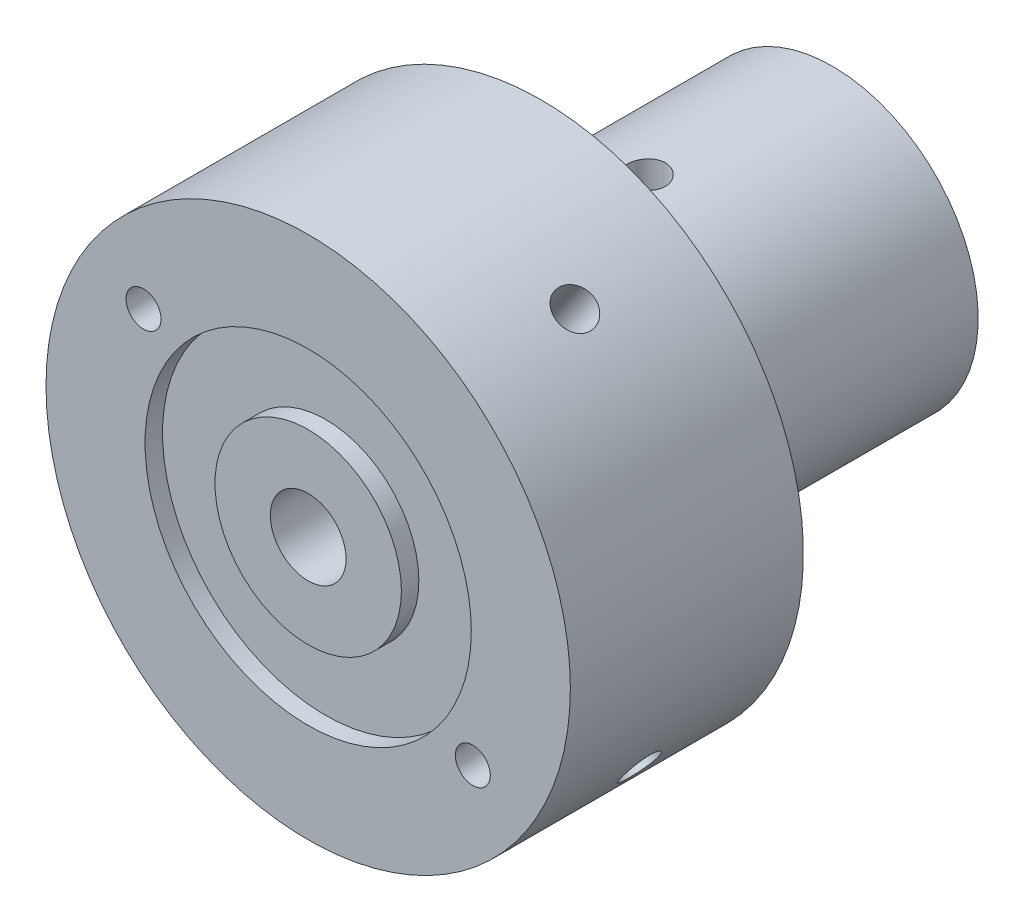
ISO-10303-21;
HEADER;
FILE_DESCRIPTION(('STEP AP214'),'2;1');
FILE_NAME('part.step','',(''),(''),'','','');
FILE_SCHEMA(('AUTOMOTIVE_DESIGN { 1 0 10303 214 1 1 1 1 }'));
ENDSEC;
DATA;
#1=APPLICATION_CONTEXT('core data for automotive mechanical design processes');
#2=APPLICATION_PROTOCOL_DEFINITION('international standard','automotive_design',2000,#1);
#3=PRODUCT_CONTEXT('',#1,'mechanical');
#4=PRODUCT('Part','Part','',(#3));
#5=PRODUCT_RELATED_PRODUCT_CATEGORY('part','',(#4));
#6=PRODUCT_DEFINITION_FORMATION('','',#4);
#7=PRODUCT_DEFINITION_CONTEXT('part definition',#1,'design');
#8=PRODUCT_DEFINITION('design','',#6,#7);
#9=PRODUCT_DEFINITION_SHAPE('','',#8);
#10=(LENGTH_UNIT() NAMED_UNIT(*) SI_UNIT(.MILLI.,.METRE.));
#11=(NAMED_UNIT(*) PLANE_ANGLE_UNIT() SI_UNIT($,.RADIAN.));
#12=(NAMED_UNIT(*) SI_UNIT($,.STERADIAN.) SOLID_ANGLE_UNIT());
#13=UNCERTAINTY_MEASURE_WITH_UNIT(LENGTH_MEASURE(1.E-05),#10,'distance_accuracy_value','');
#14=(GEOMETRIC_REPRESENTATION_CONTEXT(3) GLOBAL_UNCERTAINTY_ASSIGNED_CONTEXT((#13)) GLOBAL_UNIT_ASSIGNED_CONTEXT((#10,
#11,#12)) REPRESENTATION_CONTEXT('',''));
#15=CARTESIAN_POINT('',(0.,0.,0.));
#16=DIRECTION('',(0.,0.,1.));
#17=DIRECTION('',(1.,0.,0.));
#18=AXIS2_PLACEMENT_3D('',#15,#16,#17);
#19=CARTESIAN_POINT('',(-56.6497442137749,39.8941935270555,0.));
#20=DIRECTION('',(0.,0.,1.));
#21=DIRECTION('',(1.,0.,0.));
#22=AXIS2_PLACEMENT_3D('',#19,#20,#21);
#23=CYLINDRICAL_SURFACE('',#22,1.5);
#24=CARTESIAN_POINT('',(-55.1497442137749,39.8941935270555,33.5920679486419));
#25=CARTESIAN_POINT('',(-55.1497413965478,40.0088440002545,33.6494705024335));
#26=CARTESIAN_POINT('',(-55.1628594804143,40.1203065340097,33.7136233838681));
#27=CARTESIAN_POINT('',(-55.1993302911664,40.2806315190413,33.8142409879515));
#28=CARTESIAN_POINT('',(-55.2143544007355,40.3330704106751,33.8486177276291));
#29=CARTESIAN_POINT('',(-55.2498453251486,40.4356930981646,33.9179218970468));
#30=CARTESIAN_POINT('',(-55.2703083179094,40.4858784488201,33.9528489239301));
#31=CARTESIAN_POINT('',(-55.321829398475,40.5949493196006,34.0297879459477));
#32=CARTESIAN_POINT('',(-55.3542302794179,40.6533002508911,34.0716559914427));
#33=CARTESIAN_POINT('',(-55.4279369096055,40.7669856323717,34.1512707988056));
#34=CARTESIAN_POINT('',(-55.46920607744,40.8223313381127,34.1890335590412));
#35=CARTESIAN_POINT('',(-55.5409828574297,40.9051843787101,34.2389000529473));
#36=CARTESIAN_POINT('',(-55.5676196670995,40.9337108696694,34.2547865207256));
#37=CARTESIAN_POINT('',(-55.6242874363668,40.9896471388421,34.2817026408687));
#38=CARTESIAN_POINT('',(-55.654310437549,41.0170593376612,34.2927433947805));
#39=CARTESIAN_POINT('',(-55.7180783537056,41.0705204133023,34.308146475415));
#40=CARTESIAN_POINT('',(-55.7518723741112,41.0965426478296,34.3124060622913));
#41=CARTESIAN_POINT('',(-55.8215999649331,41.1455902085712,34.3128060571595));
#42=CARTESIAN_POINT('',(-55.8575328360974,41.1686165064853,34.3089491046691));
#43=CARTESIAN_POINT('',(-55.9336459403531,41.2130351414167,34.2933979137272));
#44=CARTESIAN_POINT('',(-55.9738921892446,41.2340351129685,34.2809599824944));
#45=CARTESIAN_POINT('',(-56.0542700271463,41.2716538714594,34.2502086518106));
#46=CARTESIAN_POINT('',(-56.0944003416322,41.2882530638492,34.2318697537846));
#47=CARTESIAN_POINT('',(-56.1720781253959,41.3166736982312,34.1927472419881));
#48=CARTESIAN_POINT('',(-56.2096468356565,41.3287067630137,34.1721521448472));
#49=CARTESIAN_POINT('',(-56.2845882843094,41.3495880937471,34.1290481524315));
#50=CARTESIAN_POINT('',(-56.3219608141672,41.3584334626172,34.1065375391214));
#51=CARTESIAN_POINT('',(-56.4340688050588,41.3805677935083,34.037430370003));
#52=CARTESIAN_POINT('',(-56.5087418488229,41.3894362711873,33.9892880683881));
#53=CARTESIAN_POINT('',(-56.6675774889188,41.3964344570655,33.8872296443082));
#54=CARTESIAN_POINT('',(-56.7518006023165,41.3931433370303,33.8333159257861));
#55=CARTESIAN_POINT('',(-56.9206228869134,41.3719733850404,33.7291329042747));
#56=CARTESIAN_POINT('',(-57.0052211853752,41.3541191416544,33.6788576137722));
#57=CARTESIAN_POINT('',(-57.1565896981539,41.3077176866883,33.5946587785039));
#58=CARTESIAN_POINT('',(-57.2235308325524,41.2820351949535,33.5594784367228));
#59=CARTESIAN_POINT('',(-57.3554302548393,41.219827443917,33.4954824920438));
#60=CARTESIAN_POINT('',(-57.4203906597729,41.183314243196,33.4666598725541));
#61=CARTESIAN_POINT('',(-57.536133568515,41.105948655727,33.4213976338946));
#62=CARTESIAN_POINT('',(-57.5875179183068,41.066734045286,33.4037128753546));
#63=CARTESIAN_POINT('',(-57.6858230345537,40.9808356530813,33.3754460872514));
#64=CARTESIAN_POINT('',(-57.7327466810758,40.9341567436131,33.3648594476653));
#65=CARTESIAN_POINT('',(-57.8206339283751,40.8341217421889,33.3515869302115));
#66=CARTESIAN_POINT('',(-57.8615729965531,40.7807397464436,33.3489327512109));
#67=CARTESIAN_POINT('',(-57.9358183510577,40.6691168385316,33.3518471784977));
#68=CARTESIAN_POINT('',(-57.969124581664,40.6108758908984,33.3574158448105));
#69=CARTESIAN_POINT('',(-58.0254236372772,40.4953387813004,33.3756955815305));
#70=CARTESIAN_POINT('',(-58.0489369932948,40.4382173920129,33.3879307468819));
#71=CARTESIAN_POINT('',(-58.0884369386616,40.3230035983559,33.4183729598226));
#72=CARTESIAN_POINT('',(-58.1044211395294,40.2649108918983,33.4365818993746));
#73=CARTESIAN_POINT('',(-58.1334416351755,40.1287700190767,33.4852092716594));
#74=CARTESIAN_POINT('',(-58.1435124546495,40.0508182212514,33.5176713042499));
#75=CARTESIAN_POINT('',(-58.1517183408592,39.8973429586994,33.5892099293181));
#76=CARTESIAN_POINT('',(-58.1498270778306,39.8218252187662,33.6283009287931));
#77=CARTESIAN_POINT('',(-58.1330905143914,39.6507879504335,33.724056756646));
#78=CARTESIAN_POINT('',(-58.1143116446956,39.5565574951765,33.7823536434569));
#79=CARTESIAN_POINT('',(-58.07377210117,39.4205006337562,33.8718660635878));
#80=CARTESIAN_POINT('',(-58.0581807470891,39.3759985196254,33.9020714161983));
#81=CARTESIAN_POINT('',(-58.0229020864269,39.2886747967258,33.9625132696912));
#82=CARTESIAN_POINT('',(-58.0032166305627,39.2458524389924,33.9927497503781));
#83=CARTESIAN_POINT('',(-57.9551763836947,39.153173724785,34.0585291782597));
#84=CARTESIAN_POINT('',(-57.9258715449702,39.1036770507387,34.0938878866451));
#85=CARTESIAN_POINT('',(-57.8605033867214,39.0067959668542,34.1611088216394));
#86=CARTESIAN_POINT('',(-57.8244519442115,38.9594080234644,34.1929770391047));
#87=CARTESIAN_POINT('',(-57.7586066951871,38.8832679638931,34.2388962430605));
#88=CARTESIAN_POINT('',(-57.7311706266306,38.8539000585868,34.2552471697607));
#89=CARTESIAN_POINT('',(-57.6726956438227,38.7963583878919,34.2827570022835));
#90=CARTESIAN_POINT('',(-57.6416668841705,38.7681815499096,34.2939301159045));
#91=CARTESIAN_POINT('',(-57.5813976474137,38.7180541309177,34.3078199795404));
#92=CARTESIAN_POINT('',(-57.552645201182,38.6958218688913,34.3115914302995));
#93=CARTESIAN_POINT('',(-57.4934858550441,38.6534588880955,34.3132692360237));
#94=CARTESIAN_POINT('',(-57.4630799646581,38.6333269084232,34.3111791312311));
#95=CARTESIAN_POINT('',(-57.3949733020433,38.5916765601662,34.3005053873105));
#96=CARTESIAN_POINT('',(-57.3571021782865,38.5707812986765,34.2906295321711));
#97=CARTESIAN_POINT('',(-57.2813148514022,38.5329697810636,34.2649674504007));
#98=CARTESIAN_POINT('',(-57.2433990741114,38.5160697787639,34.2491577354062));
#99=CARTESIAN_POINT('',(-57.1713304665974,38.4873126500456,34.2153764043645));
#100=CARTESIAN_POINT('',(-57.1371463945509,38.4751383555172,34.1977279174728));
#101=CARTESIAN_POINT('',(-57.0689921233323,38.4535309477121,34.1604273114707));
#102=CARTESIAN_POINT('',(-57.0350221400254,38.444100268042,34.1407734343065));
#103=CARTESIAN_POINT('',(-56.9331183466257,38.419539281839,34.0799423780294));
#104=CARTESIAN_POINT('',(-56.865329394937,38.4081936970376,34.0369684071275));
#105=CARTESIAN_POINT('',(-56.7492899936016,38.3967227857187,33.962691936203));
#106=CARTESIAN_POINT('',(-56.7010838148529,38.3942955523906,33.9316251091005));
#107=CARTESIAN_POINT('',(-56.6044634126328,38.3940976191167,33.8697749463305));
#108=CARTESIAN_POINT('',(-56.5560491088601,38.3963289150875,33.8389917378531));
#109=CARTESIAN_POINT('',(-56.4107350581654,38.4101701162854,33.7482652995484));
#110=CARTESIAN_POINT('',(-56.3134385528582,38.4288938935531,33.6897269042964));
#111=CARTESIAN_POINT('',(-56.1493896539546,38.478357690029,33.5981370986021));
#112=CARTESIAN_POINT('',(-56.0823122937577,38.5037400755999,33.5627365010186));
#113=CARTESIAN_POINT('',(-55.9500988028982,38.5653612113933,33.49825497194));
#114=CARTESIAN_POINT('',(-55.8849601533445,38.6015851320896,33.4691655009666));
#115=CARTESIAN_POINT('',(-55.7687861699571,38.6784799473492,33.4233592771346));
#116=CARTESIAN_POINT('',(-55.7171603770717,38.7175155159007,33.4054082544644));
#117=CARTESIAN_POINT('',(-55.6183328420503,38.8031143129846,33.3766049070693));
#118=CARTESIAN_POINT('',(-55.5711284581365,38.8496730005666,33.3657483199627));
#119=CARTESIAN_POINT('',(-55.4826534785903,38.9495427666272,33.351953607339));
#120=CARTESIAN_POINT('',(-55.4414077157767,39.0028804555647,33.3490477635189));
#121=CARTESIAN_POINT('',(-55.3665497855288,39.1144968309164,33.3515027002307));
#122=CARTESIAN_POINT('',(-55.3329380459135,39.1727757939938,33.3568639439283));
#123=CARTESIAN_POINT('',(-55.2761410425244,39.2883148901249,33.3747763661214));
#124=CARTESIAN_POINT('',(-55.2524158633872,39.3453904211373,33.3868320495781));
#125=CARTESIAN_POINT('',(-55.2125029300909,39.4605430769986,33.4169428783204));
#126=CARTESIAN_POINT('',(-55.1963148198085,39.5186201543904,33.4349977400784));
#127=CARTESIAN_POINT('',(-55.1721457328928,39.6301615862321,33.4745609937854));
#128=CARTESIAN_POINT('',(-55.1636387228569,39.6836441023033,33.4957071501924));
#129=CARTESIAN_POINT('',(-55.1524375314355,39.7897004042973,33.5414625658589));
#130=CARTESIAN_POINT('',(-55.1497454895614,39.8422738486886,33.5660730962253));
#131=CARTESIAN_POINT('',(-55.1497442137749,39.8941935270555,33.5920679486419));
#132=B_SPLINE_CURVE_WITH_KNOTS('',3,(#24,#25,#26,#27,#28,#29,#30,#31,#32,#33,#34,#35,#36,#37,
#38,#39,#40,#41,#42,#43,#44,#45,#46,#47,#48,#49,#50,#51,#52,#53,#54,#55,#56,#57,#58,#59,#60,#61,
#62,#63,#64,#65,#66,#67,#68,#69,#70,#71,#72,#73,#74,#75,#76,#77,#78,#79,#80,#81,#82,#83,#84,#85,
#86,#87,#88,#89,#90,#91,#92,#93,#94,#95,#96,#97,#98,#99,#100,#101,#102,#103,#104,#105,#106,#107,
#108,#109,#110,#111,#112,#113,#114,#115,#116,#117,#118,#119,#120,#121,#122,#123,#124,#125,#126,
#127,#128,#129,#130,#131),.UNSPECIFIED.,.T.,.F.,(4,2,2,2,2,2,2,2,2,2,2,2,2,2,2,2,2,2,2,2,2,2,2,
2,2,2,2,2,2,2,2,2,2,2,2,2,2,2,2,2,2,2,2,2,2,2,2,2,2,2,2,2,2,4),(0.,0.384290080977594,
0.577559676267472,0.770693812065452,1.00659959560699,1.24155034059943,1.36766266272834,
1.49348453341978,1.62119515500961,1.74886425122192,1.88927376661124,2.0302983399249,
2.16361143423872,2.29704538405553,2.56410155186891,2.86329720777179,3.16198874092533,
3.4007418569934,3.6392301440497,3.8394299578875,4.03949962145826,4.2403677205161,
4.44123728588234,4.62935398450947,4.81753031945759,5.07124352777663,5.32551537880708,
5.66076334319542,5.82863860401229,5.99643814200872,6.1986691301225,6.40054739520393,
6.53038627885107,6.65986674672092,6.76895439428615,6.87797616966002,7.01029585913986,
7.14314493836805,7.26402435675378,7.38501067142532,7.62747520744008,7.7995101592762,
7.97161883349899,8.31466900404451,8.55380873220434,8.79262283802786,8.99327915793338,
9.19381481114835,9.39516348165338,9.59652343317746,9.78465468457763,9.97277704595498,
10.1467395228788,10.3207659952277),.UNSPECIFIED.);
#133=CARTESIAN_POINT('',(-55.1497442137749,39.8941935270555,33.5920679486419));
#134=VERTEX_POINT('',#133);
#135=EDGE_CURVE('E65',#134,#134,#132,.T.);
#136=ORIENTED_EDGE('',*,*,#135,.T.);
#137=EDGE_LOOP('',(#136));
#138=FACE_BOUND('',#137,.T.);
#139=CARTESIAN_POINT('',(-56.6497442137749,39.8941935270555,25.));
#140=DIRECTION('',(0.,0.,-1.));
#141=DIRECTION('',(-1.,0.,0.));
#142=AXIS2_PLACEMENT_3D('',#139,#140,#141);
#143=CIRCLE('',#142,1.5);
#144=CARTESIAN_POINT('',(-58.1497442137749,39.8941935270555,25.));
#145=VERTEX_POINT('',#144);
#146=EDGE_CURVE('E184',#145,#145,#143,.T.);
#147=ORIENTED_EDGE('',*,*,#146,.T.);
#148=EDGE_LOOP('',(#147));
#149=FACE_BOUND('',#148,.T.);
#150=ADVANCED_FACE('F16',(#138,#149),#23,.F.);
#151=CARTESIAN_POINT('',(-42.5193714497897,30.,45.));
#152=DIRECTION('',(0.,0.,1.));
#153=DIRECTION('',(1.,0.,0.));
#154=AXIS2_PLACEMENT_3D('',#151,#152,#153);
#155=PLANE('',#154);
#156=CARTESIAN_POINT('',(-42.5193714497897,30.,45.));
#157=DIRECTION('',(0.,0.,1.));
#158=DIRECTION('',(1.,0.,0.));
#159=AXIS2_PLACEMENT_3D('',#156,#157,#158);
#160=CIRCLE('',#159,3.25);
#161=CARTESIAN_POINT('',(-39.2693714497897,30.,45.));
#162=VERTEX_POINT('',#161);
#163=EDGE_CURVE('E210',#162,#162,#160,.T.);
#164=ORIENTED_EDGE('',*,*,#163,.F.);
#165=EDGE_LOOP('',(#164));
#166=FACE_BOUND('',#165,.T.);
#167=CARTESIAN_POINT('',(-42.5193714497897,30.,45.));
#168=DIRECTION('',(0.,0.,1.));
#169=DIRECTION('',(1.,0.,0.));
#170=AXIS2_PLACEMENT_3D('',#167,#168,#169);
#171=CIRCLE('',#170,8.);
#172=CARTESIAN_POINT('',(-34.5193714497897,30.,45.));
#173=VERTEX_POINT('',#172);
#174=EDGE_CURVE('E443',#173,#173,#171,.T.);
#175=ORIENTED_EDGE('',*,*,#174,.T.);
#176=EDGE_LOOP('',(#175));
#177=FACE_BOUND('',#176,.T.);
#178=ADVANCED_FACE('F158',(#166,#177),#155,.T.);
#179=CARTESIAN_POINT('',(-28.3889986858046,20.1058064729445,0.));
#180=DIRECTION('',(0.,0.,1.));
#181=DIRECTION('',(1.,0.,0.));
#182=AXIS2_PLACEMENT_3D('',#179,#180,#181);
#183=CYLINDRICAL_SURFACE('',#182,1.5);
#184=CARTESIAN_POINT('',(-26.8889986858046,20.1058064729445,33.592067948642));
#185=CARTESIAN_POINT('',(-26.8889958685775,20.2204569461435,33.6494705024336));
#186=CARTESIAN_POINT('',(-26.902113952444,20.3319194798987,33.7136233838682));
#187=CARTESIAN_POINT('',(-26.9385847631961,20.4922444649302,33.8142409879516));
#188=CARTESIAN_POINT('',(-26.9536088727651,20.544683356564,33.8486177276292));
#189=CARTESIAN_POINT('',(-26.9890997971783,20.6473060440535,33.9179218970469));
#190=CARTESIAN_POINT('',(-27.0095627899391,20.697491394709,33.9528489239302));
#191=CARTESIAN_POINT('',(-27.0610838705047,20.8065622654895,34.0297879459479));
#192=CARTESIAN_POINT('',(-27.0934847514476,20.86491319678,34.0716559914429));
#193=CARTESIAN_POINT('',(-27.1671913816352,20.9785985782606,34.1512707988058));
#194=CARTESIAN_POINT('',(-27.2084605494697,21.0339442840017,34.1890335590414));
#195=CARTESIAN_POINT('',(-27.2802373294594,21.116797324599,34.2389000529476));
#196=CARTESIAN_POINT('',(-27.3068741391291,21.1453238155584,34.254786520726));
#197=CARTESIAN_POINT('',(-27.3635419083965,21.2012600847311,34.2817026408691));
#198=CARTESIAN_POINT('',(-27.3935649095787,21.2286722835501,34.2927433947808));
#199=CARTESIAN_POINT('',(-27.4573328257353,21.2821333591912,34.3081464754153));
#200=CARTESIAN_POINT('',(-27.4911268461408,21.3081555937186,34.3124060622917));
#201=CARTESIAN_POINT('',(-27.5608544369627,21.3572031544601,34.3128060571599));
#202=CARTESIAN_POINT('',(-27.5967873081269,21.3802294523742,34.3089491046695));
#203=CARTESIAN_POINT('',(-27.6729004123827,21.4246480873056,34.2933979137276));
#204=CARTESIAN_POINT('',(-27.7131466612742,21.4456480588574,34.2809599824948));
#205=CARTESIAN_POINT('',(-27.7935244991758,21.4832668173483,34.2502086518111));
#206=CARTESIAN_POINT('',(-27.8336548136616,21.4998660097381,34.231869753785));
#207=CARTESIAN_POINT('',(-27.9113325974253,21.5282866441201,34.1927472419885));
#208=CARTESIAN_POINT('',(-27.9489013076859,21.5403197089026,34.1721521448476));
#209=CARTESIAN_POINT('',(-28.0238427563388,21.5612010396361,34.129048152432));
#210=CARTESIAN_POINT('',(-28.0612152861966,21.5700464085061,34.1065375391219));
#211=CARTESIAN_POINT('',(-28.1733232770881,21.5921807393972,34.0374303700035));
#212=CARTESIAN_POINT('',(-28.2479963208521,21.6010492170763,33.9892880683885));
#213=CARTESIAN_POINT('',(-28.406831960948,21.6080474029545,33.8872296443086));
#214=CARTESIAN_POINT('',(-28.4910550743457,21.6047562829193,33.8333159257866));
#215=CARTESIAN_POINT('',(-28.6598773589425,21.5835863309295,33.7291329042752));
#216=CARTESIAN_POINT('',(-28.7444756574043,21.5657320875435,33.6788576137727));
#217=CARTESIAN_POINT('',(-28.8958441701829,21.5193306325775,33.5946587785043));
#218=CARTESIAN_POINT('',(-28.9627853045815,21.4936481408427,33.5594784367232));
#219=CARTESIAN_POINT('',(-29.0946847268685,21.4314403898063,33.4954824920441));
#220=CARTESIAN_POINT('',(-29.1596451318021,21.3949271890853,33.4666598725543));
#221=CARTESIAN_POINT('',(-29.2753880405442,21.3175616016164,33.4213976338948));
#222=CARTESIAN_POINT('',(-29.3267723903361,21.2783469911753,33.4037128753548));
#223=CARTESIAN_POINT('',(-29.425077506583,21.1924485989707,33.3754460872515));
#224=CARTESIAN_POINT('',(-29.4720011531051,21.1457696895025,33.3648594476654));
#225=CARTESIAN_POINT('',(-29.5598884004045,21.0457346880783,33.3515869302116));
#226=CARTESIAN_POINT('',(-29.6008274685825,20.992352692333,33.3489327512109));
#227=CARTESIAN_POINT('',(-29.6750728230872,20.880729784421,33.3518471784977));
#228=CARTESIAN_POINT('',(-29.7083790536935,20.8224888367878,33.3574158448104));
#229=CARTESIAN_POINT('',(-29.7646781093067,20.7069517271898,33.3756955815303));
#230=CARTESIAN_POINT('',(-29.7881914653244,20.6498303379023,33.3879307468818));
#231=CARTESIAN_POINT('',(-29.8276914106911,20.5346165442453,33.4183729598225));
#232=CARTESIAN_POINT('',(-29.843675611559,20.4765238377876,33.4365818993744));
#233=CARTESIAN_POINT('',(-29.8726961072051,20.340382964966,33.4852092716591));
#234=CARTESIAN_POINT('',(-29.8827669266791,20.2624311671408,33.5176713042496));
#235=CARTESIAN_POINT('',(-29.8909728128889,20.1089559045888,33.5892099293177));
#236=CARTESIAN_POINT('',(-29.8890815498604,20.0334381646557,33.6283009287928));
#237=CARTESIAN_POINT('',(-29.8723449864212,19.862400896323,33.7240567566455));
#238=CARTESIAN_POINT('',(-29.8535661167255,19.768170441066,33.7823536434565));
#239=CARTESIAN_POINT('',(-29.8130265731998,19.6321135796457,33.8718660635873));
#240=CARTESIAN_POINT('',(-29.797435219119,19.587611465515,33.9020714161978));
#241=CARTESIAN_POINT('',(-29.7621565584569,19.5002877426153,33.9625132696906));
#242=CARTESIAN_POINT('',(-29.7424711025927,19.457465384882,33.9927497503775));
#243=CARTESIAN_POINT('',(-29.6944308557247,19.3647866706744,34.0585291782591));
#244=CARTESIAN_POINT('',(-29.6651260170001,19.315289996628,34.0938878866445));
#245=CARTESIAN_POINT('',(-29.5997578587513,19.2184089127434,34.161108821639));
#246=CARTESIAN_POINT('',(-29.5637064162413,19.1710209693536,34.1929770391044));
#247=CARTESIAN_POINT('',(-29.4978611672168,19.0948809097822,34.2388962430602));
#248=CARTESIAN_POINT('',(-29.4704250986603,19.0655130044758,34.2552471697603));
#249=CARTESIAN_POINT('',(-29.4119501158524,19.0079713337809,34.2827570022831));
#250=CARTESIAN_POINT('',(-29.3809213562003,18.9797944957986,34.2939301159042));
#251=CARTESIAN_POINT('',(-29.3206521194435,18.9296670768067,34.3078199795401));
#252=CARTESIAN_POINT('',(-29.2918996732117,18.9074348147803,34.3115914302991));
#253=CARTESIAN_POINT('',(-29.2327403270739,18.8650718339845,34.3132692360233));
#254=CARTESIAN_POINT('',(-29.2023344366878,18.8449398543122,34.3111791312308));
#255=CARTESIAN_POINT('',(-29.134227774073,18.8032895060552,34.3005053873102));
#256=CARTESIAN_POINT('',(-29.0963566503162,18.7823942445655,34.2906295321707));
#257=CARTESIAN_POINT('',(-29.0205693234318,18.7445827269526,34.2649674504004));
#258=CARTESIAN_POINT('',(-28.982653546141,18.7276827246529,34.2491577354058));
#259=CARTESIAN_POINT('',(-28.9105849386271,18.6989255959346,34.2153764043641));
#260=CARTESIAN_POINT('',(-28.8764008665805,18.6867513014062,34.1977279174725));
#261=CARTESIAN_POINT('',(-28.8082465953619,18.6651438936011,34.1604273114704));
#262=CARTESIAN_POINT('',(-28.774276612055,18.655713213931,34.1407734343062));
#263=CARTESIAN_POINT('',(-28.6723728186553,18.6311522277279,34.0799423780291));
#264=CARTESIAN_POINT('',(-28.6045838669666,18.6198066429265,34.0369684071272));
#265=CARTESIAN_POINT('',(-28.4885444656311,18.6083357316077,33.9626919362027));
#266=CARTESIAN_POINT('',(-28.4403382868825,18.6059084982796,33.9316251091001));
#267=CARTESIAN_POINT('',(-28.3437178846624,18.6057105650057,33.8697749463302));
#268=CARTESIAN_POINT('',(-28.2953035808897,18.6079418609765,33.8389917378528));
#269=CARTESIAN_POINT('',(-28.149989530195,18.6217830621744,33.7482652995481));
#270=CARTESIAN_POINT('',(-28.0526930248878,18.6405068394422,33.6897269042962));
#271=CARTESIAN_POINT('',(-27.8886441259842,18.689970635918,33.5981370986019));
#272=CARTESIAN_POINT('',(-27.8215667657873,18.7153530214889,33.5627365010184));
#273=CARTESIAN_POINT('',(-27.6893532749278,18.7769741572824,33.4982549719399));
#274=CARTESIAN_POINT('',(-27.6242146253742,18.8131980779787,33.4691655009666));
#275=CARTESIAN_POINT('',(-27.5080406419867,18.8900928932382,33.4233592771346));
#276=CARTESIAN_POINT('',(-27.4564148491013,18.9291284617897,33.4054082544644));
#277=CARTESIAN_POINT('',(-27.3575873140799,19.0147272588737,33.3766049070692));
#278=CARTESIAN_POINT('',(-27.3103829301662,19.0612859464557,33.3657483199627));
#279=CARTESIAN_POINT('',(-27.22190795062,19.1611557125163,33.351953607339));
#280=CARTESIAN_POINT('',(-27.1806621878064,19.2144934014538,33.3490477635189));
#281=CARTESIAN_POINT('',(-27.1058042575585,19.3261097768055,33.3515027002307));
#282=CARTESIAN_POINT('',(-27.0721925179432,19.3843887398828,33.3568639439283));
#283=CARTESIAN_POINT('',(-27.0153955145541,19.499927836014,33.3747763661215));
#284=CARTESIAN_POINT('',(-26.9916703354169,19.5570033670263,33.3868320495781));
#285=CARTESIAN_POINT('',(-26.9517574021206,19.6721560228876,33.4169428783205));
#286=CARTESIAN_POINT('',(-26.9355692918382,19.7302331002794,33.4349977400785));
#287=CARTESIAN_POINT('',(-26.9114002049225,19.8417745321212,33.4745609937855));
#288=CARTESIAN_POINT('',(-26.9028931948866,19.8952570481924,33.4957071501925));
#289=CARTESIAN_POINT('',(-26.8916920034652,20.0013133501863,33.541462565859));
#290=CARTESIAN_POINT('',(-26.8889999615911,20.0538867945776,33.5660730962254));
#291=CARTESIAN_POINT('',(-26.8889986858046,20.1058064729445,33.592067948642));
#292=B_SPLINE_CURVE_WITH_KNOTS('',3,(#184,#185,#186,#187,#188,#189,#190,#191,#192,#193,#194,
#195,#196,#197,#198,#199,#200,#201,#202,#203,#204,#205,#206,#207,#208,#209,#210,#211,#212,#213,
#214,#215,#216,#217,#218,#219,#220,#221,#222,#223,#224,#225,#226,#227,#228,#229,#230,#231,#232,
#233,#234,#235,#236,#237,#238,#239,#240,#241,#242,#243,#244,#245,#246,#247,#248,#249,#250,#251,
#252,#253,#254,#255,#256,#257,#258,#259,#260,#261,#262,#263,#264,#265,#266,#267,#268,#269,#270,
#271,#272,#273,#274,#275,#276,#277,#278,#279,#280,#281,#282,#283,#284,#285,#286,#287,#288,#289,
#290,#291),.UNSPECIFIED.,.T.,.F.,(4,2,2,2,2,2,2,2,2,2,2,2,2,2,2,2,2,2,2,2,2,2,2,2,2,2,2,2,2,2,2,
2,2,2,2,2,2,2,2,2,2,2,2,2,2,2,2,2,2,2,2,2,2,4),(0.,0.384290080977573,0.577559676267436,
0.770693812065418,1.00659959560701,1.2415503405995,1.3676626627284,1.49348453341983,
1.62119515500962,1.74886425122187,1.88927376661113,2.03029833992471,2.16361143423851,
2.29704538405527,2.56410155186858,2.86329720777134,3.16198874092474,3.40074185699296,
3.63923014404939,3.83942995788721,4.039499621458,4.24036772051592,4.44123728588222,
4.62935398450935,4.81753031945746,5.0712435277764,5.32551537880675,5.66076334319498,
5.82863860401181,5.99643814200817,6.19866913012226,6.40054739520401,6.53038627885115,
6.659866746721,6.76895439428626,6.87797616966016,7.01029585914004,7.14314493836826,
7.26402435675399,7.38501067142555,7.62747520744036,7.79951015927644,7.97161883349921,
8.31466900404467,8.55380873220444,8.79262283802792,8.99327915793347,9.19381481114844,
9.39516348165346,9.59652343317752,9.78465468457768,9.97277704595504,10.1467395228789,
10.3207659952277),.UNSPECIFIED.);
#293=CARTESIAN_POINT('',(-26.8889986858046,20.1058064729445,33.592067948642));
#294=VERTEX_POINT('',#293);
#295=EDGE_CURVE('E416',#294,#294,#292,.T.);
#296=ORIENTED_EDGE('',*,*,#295,.T.);
#297=EDGE_LOOP('',(#296));
#298=FACE_BOUND('',#297,.T.);
#299=CARTESIAN_POINT('',(-28.3889986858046,20.1058064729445,25.));
#300=DIRECTION('',(0.,0.,-1.));
#301=DIRECTION('',(-1.,0.,0.));
#302=AXIS2_PLACEMENT_3D('',#299,#300,#301);
#303=CIRCLE('',#302,1.5);
#304=CARTESIAN_POINT('',(-29.8889986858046,20.1058064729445,25.));
#305=VERTEX_POINT('',#304);
#306=EDGE_CURVE('E193',#305,#305,#303,.T.);
#307=ORIENTED_EDGE('',*,*,#306,.T.);
#308=EDGE_LOOP('',(#307));
#309=FACE_BOUND('',#308,.T.);
#310=ADVANCED_FACE('F161',(#298,#309),#183,.F.);
#311=CARTESIAN_POINT('',(-42.5193714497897,30.,0.));
#312=DIRECTION('',(0.,0.,1.));
#313=DIRECTION('',(1.,0.,0.));
#314=AXIS2_PLACEMENT_3D('',#311,#312,#313);
#315=PLANE('',#314);
#316=CARTESIAN_POINT('',(-42.5193714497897,30.,0.));
#317=DIRECTION('',(0.,0.,1.));
#318=DIRECTION('',(1.,0.,0.));
#319=AXIS2_PLACEMENT_3D('',#316,#317,#318);
#320=CIRCLE('',#319,3.25);
#321=CARTESIAN_POINT('',(-39.2693714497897,30.,0.));
#322=VERTEX_POINT('',#321);
#323=EDGE_CURVE('E213',#322,#322,#320,.T.);
#324=ORIENTED_EDGE('',*,*,#323,.T.);
#325=EDGE_LOOP('',(#324));
#326=FACE_BOUND('',#325,.T.);
#327=CARTESIAN_POINT('',(-42.5193714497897,30.,0.));
#328=DIRECTION('',(0.,0.,-1.));
#329=DIRECTION('',(-1.,0.,0.));
#330=AXIS2_PLACEMENT_3D('',#327,#328,#329);
#331=CIRCLE('',#330,12.5);
#332=CARTESIAN_POINT('',(-55.0193714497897,30.,0.));
#333=VERTEX_POINT('',#332);
#334=EDGE_CURVE('E186',#333,#333,#331,.T.);
#335=ORIENTED_EDGE('',*,*,#334,.T.);
#336=EDGE_LOOP('',(#335));
#337=FACE_BOUND('',#336,.T.);
#338=ADVANCED_FACE('F159',(#326,#337),#315,.F.);
#339=CARTESIAN_POINT('',(-42.5193714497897,30.,45.));
#340=DIRECTION('',(0.,0.,-1.));
#341=DIRECTION('',(-1.,0.,0.));
#342=AXIS2_PLACEMENT_3D('',#339,#340,#341);
#343=CYLINDRICAL_SURFACE('',#342,22.5);
#344=CARTESIAN_POINT('',(-31.0002506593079,49.3276966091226,35.));
#345=CARTESIAN_POINT('',(-31.0002468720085,49.3276949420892,34.9074525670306));
#346=CARTESIAN_POINT('',(-30.9935190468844,49.3236895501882,34.8148412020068));
#347=CARTESIAN_POINT('',(-30.9668055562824,49.3077304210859,34.6321782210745));
#348=CARTESIAN_POINT('',(-30.9468046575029,49.295767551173,34.5421296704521));
#349=CARTESIAN_POINT('',(-30.8942059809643,49.2641237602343,34.3672644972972));
#350=CARTESIAN_POINT('',(-30.8616150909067,49.2444470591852,34.2824450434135));
#351=CARTESIAN_POINT('',(-30.7848976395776,49.1977636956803,34.1204068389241));
#352=CARTESIAN_POINT('',(-30.7407736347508,49.1707586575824,34.043186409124));
#353=CARTESIAN_POINT('',(-30.642299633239,49.1099060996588,33.8983611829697));
#354=CARTESIAN_POINT('',(-30.5879315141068,49.0760464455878,33.8307738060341));
#355=CARTESIAN_POINT('',(-30.4707191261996,49.0022305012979,33.707282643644));
#356=CARTESIAN_POINT('',(-30.4078744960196,48.9622739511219,33.6513793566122));
#357=CARTESIAN_POINT('',(-30.2755678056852,48.8771146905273,33.5527872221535));
#358=CARTESIAN_POINT('',(-30.2060984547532,48.8319061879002,33.5101131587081));
#359=CARTESIAN_POINT('',(-30.0627063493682,48.7373653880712,33.4392854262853));
#360=CARTESIAN_POINT('',(-29.9887836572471,48.6880331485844,33.4111315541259));
#361=CARTESIAN_POINT('',(-29.8388213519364,48.5866033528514,33.370192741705));
#362=CARTESIAN_POINT('',(-29.7627858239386,48.5345109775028,33.3573800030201));
#363=CARTESIAN_POINT('',(-29.6106809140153,48.4288979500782,33.3474012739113));
#364=CARTESIAN_POINT('',(-29.5346115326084,48.3753773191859,33.3502350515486));
#365=CARTESIAN_POINT('',(-29.3847415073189,48.2685508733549,33.3714460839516));
#366=CARTESIAN_POINT('',(-29.3109367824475,48.2152448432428,33.3897934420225));
#367=CARTESIAN_POINT('',(-29.1674693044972,48.1103454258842,33.4414643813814));
#368=CARTESIAN_POINT('',(-29.0978065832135,48.0587520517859,33.4747880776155));
#369=CARTESIAN_POINT('',(-28.9644131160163,47.9588435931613,33.5554993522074));
#370=CARTESIAN_POINT('',(-28.9006881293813,47.9105317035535,33.60290040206));
#371=CARTESIAN_POINT('',(-28.7808918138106,47.8188068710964,33.7104110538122));
#372=CARTESIAN_POINT('',(-28.7248206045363,47.7753940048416,33.7705208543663));
#373=CARTESIAN_POINT('',(-28.6216218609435,47.6948258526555,33.9019113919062));
#374=CARTESIAN_POINT('',(-28.5745156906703,47.657685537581,33.9732180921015));
#375=CARTESIAN_POINT('',(-28.4905798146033,47.5910740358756,34.1248875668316));
#376=CARTESIAN_POINT('',(-28.4537501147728,47.561602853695,34.2052503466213));
#377=CARTESIAN_POINT('',(-28.3912674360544,47.5113760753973,34.3727682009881));
#378=CARTESIAN_POINT('',(-28.3656154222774,47.4906212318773,34.4599238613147));
#379=CARTESIAN_POINT('',(-28.3261196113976,47.458586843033,34.6385452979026));
#380=CARTESIAN_POINT('',(-28.3122756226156,47.447307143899,34.7300110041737));
#381=CARTESIAN_POINT('',(-28.296751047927,47.4346543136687,34.9144282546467));
#382=CARTESIAN_POINT('',(-28.2950422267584,47.4332581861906,35.0073758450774));
#383=CARTESIAN_POINT('',(-28.3037547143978,47.4403632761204,35.1923187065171));
#384=CARTESIAN_POINT('',(-28.3141759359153,47.4488644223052,35.2843139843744));
#385=CARTESIAN_POINT('',(-28.346877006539,47.4754353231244,35.4646373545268));
#386=CARTESIAN_POINT('',(-28.3691437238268,47.4934944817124,35.5529693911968));
#387=CARTESIAN_POINT('',(-28.4249880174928,47.5385185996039,35.7235808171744));
#388=CARTESIAN_POINT('',(-28.4585657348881,47.5654836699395,35.8058601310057));
#389=CARTESIAN_POINT('',(-28.5362876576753,47.6274170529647,35.9621970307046));
#390=CARTESIAN_POINT('',(-28.5804512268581,47.6624000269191,36.0362391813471));
#391=CARTESIAN_POINT('',(-28.6782249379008,47.7391238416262,36.1738442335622));
#392=CARTESIAN_POINT('',(-28.731835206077,47.7808647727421,36.2374069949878));
#393=CARTESIAN_POINT('',(-28.8472707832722,47.8697781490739,36.3523722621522));
#394=CARTESIAN_POINT('',(-28.9091116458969,47.9169608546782,36.4037512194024));
#395=CARTESIAN_POINT('',(-29.0393345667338,48.0151393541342,36.4927290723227));
#396=CARTESIAN_POINT('',(-29.1077165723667,48.0661351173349,36.5303280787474));
#397=CARTESIAN_POINT('',(-29.2491353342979,48.1702649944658,36.5906380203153));
#398=CARTESIAN_POINT('',(-29.3221674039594,48.2233969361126,36.6133636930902));
#399=CARTESIAN_POINT('',(-29.4709475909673,48.3302214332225,36.643330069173));
#400=CARTESIAN_POINT('',(-29.5466956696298,48.3839139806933,36.6505709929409));
#401=CARTESIAN_POINT('',(-29.6985929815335,48.4901652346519,36.6493600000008));
#402=CARTESIAN_POINT('',(-29.7747408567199,48.5427263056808,36.6409448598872));
#403=CARTESIAN_POINT('',(-29.925421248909,48.6453944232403,36.6087370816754));
#404=CARTESIAN_POINT('',(-29.9999537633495,48.6955014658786,36.5849444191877));
#405=CARTESIAN_POINT('',(-30.1452088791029,48.7919585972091,36.5226658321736));
#406=CARTESIAN_POINT('',(-30.2159315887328,48.8383087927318,36.4841803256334));
#407=CARTESIAN_POINT('',(-30.3514508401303,48.9261257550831,36.3936130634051));
#408=CARTESIAN_POINT('',(-30.4162475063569,48.9675926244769,36.3415315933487));
#409=CARTESIAN_POINT('',(-30.5380801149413,49.0447861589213,36.2251133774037));
#410=CARTESIAN_POINT('',(-30.595098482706,49.0804998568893,36.1607496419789));
#411=CARTESIAN_POINT('',(-30.6994426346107,49.1453144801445,36.0216380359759));
#412=CARTESIAN_POINT('',(-30.7467660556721,49.1744137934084,35.9468876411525));
#413=CARTESIAN_POINT('',(-30.8302662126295,49.2254317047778,35.7890106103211));
#414=CARTESIAN_POINT('',(-30.8664256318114,49.2473391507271,35.7058712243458));
#415=CARTESIAN_POINT('',(-30.9262954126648,49.2834598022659,35.5337275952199));
#416=CARTESIAN_POINT('',(-30.9500202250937,49.297681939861,35.4447302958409));
#417=CARTESIAN_POINT('',(-30.978142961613,49.3145074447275,35.2959981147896));
#418=CARTESIAN_POINT('',(-30.9864211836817,49.3194487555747,35.2372223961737));
#419=CARTESIAN_POINT('',(-30.9974762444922,49.3260438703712,35.1189732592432));
#420=CARTESIAN_POINT('',(-31.0002530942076,49.3276976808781,35.0594998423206));
#421=CARTESIAN_POINT('',(-31.0002506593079,49.3276966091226,35.));
#422=B_SPLINE_CURVE_WITH_KNOTS('',3,(#344,#345,#346,#347,#348,#349,#350,#351,#352,#353,#354,
#355,#356,#357,#358,#359,#360,#361,#362,#363,#364,#365,#366,#367,#368,#369,#370,#371,#372,#373,
#374,#375,#376,#377,#378,#379,#380,#381,#382,#383,#384,#385,#386,#387,#388,#389,#390,#391,#392,
#393,#394,#395,#396,#397,#398,#399,#400,#401,#402,#403,#404,#405,#406,#407,#408,#409,#410,#411,
#412,#413,#414,#415,#416,#417,#418,#419,#420,#421),.UNSPECIFIED.,.T.,.F.,(4,2,2,2,2,2,2,2,2,2,2,
2,2,2,2,2,2,2,2,2,2,2,2,2,2,2,2,2,2,2,2,2,2,2,2,2,2,2,4),(0.,0.277425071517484,0.5551690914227,
0.832761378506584,1.11029218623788,1.38831865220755,1.66635697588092,1.94470490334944,
2.22304893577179,2.5008878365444,2.77872261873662,3.05602319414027,3.33332589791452,
3.61089482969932,3.88846810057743,4.16669477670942,4.44492161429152,4.72317246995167,
5.0014188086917,5.27901753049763,5.55661425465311,5.83390387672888,6.11119695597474,
6.38900118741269,6.66680913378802,6.94514972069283,7.2234880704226,7.5015502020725,
7.77960837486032,8.05701420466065,8.33442047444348,8.61181885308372,8.8892114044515,
9.16722067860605,9.44529763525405,9.72380378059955,10.0019855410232,10.1803457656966,
10.3587056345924),.UNSPECIFIED.);
#423=CARTESIAN_POINT('',(-31.0002506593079,49.3276966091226,35.));
#424=VERTEX_POINT('',#423);
#425=EDGE_CURVE('E11',#424,#424,#422,.T.);
#426=ORIENTED_EDGE('',*,*,#425,.T.);
#427=EDGE_LOOP('',(#426));
#428=FACE_BOUND('',#427,.T.);
#429=CARTESIAN_POINT('',(-61.8470680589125,41.5191207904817,35.));
#430=CARTESIAN_POINT('',(-61.8470663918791,41.5191245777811,34.9074525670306));
#431=CARTESIAN_POINT('',(-61.843060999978,41.5258524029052,34.8148412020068));
#432=CARTESIAN_POINT('',(-61.8271018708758,41.5525658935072,34.6321782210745));
#433=CARTESIAN_POINT('',(-61.8151390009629,41.5725667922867,34.542129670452));
#434=CARTESIAN_POINT('',(-61.7834952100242,41.6251654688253,34.3672644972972));
#435=CARTESIAN_POINT('',(-61.763818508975,41.6577563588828,34.2824450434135));
#436=CARTESIAN_POINT('',(-61.7171351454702,41.734473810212,34.1204068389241));
#437=CARTESIAN_POINT('',(-61.6901301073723,41.7785978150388,34.043186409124));
#438=CARTESIAN_POINT('',(-61.6292775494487,41.8770718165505,33.8983611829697));
#439=CARTESIAN_POINT('',(-61.5954178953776,41.9314399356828,33.8307738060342));
#440=CARTESIAN_POINT('',(-61.5216019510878,42.04865232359,33.707282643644));
#441=CARTESIAN_POINT('',(-61.4816454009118,42.11149695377,33.6513793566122));
#442=CARTESIAN_POINT('',(-61.3964861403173,42.2438036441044,33.5527872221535));
#443=CARTESIAN_POINT('',(-61.3512776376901,42.3132729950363,33.5101131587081));
#444=CARTESIAN_POINT('',(-61.2567368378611,42.4566651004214,33.4392854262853));
#445=CARTESIAN_POINT('',(-61.2074045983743,42.5305877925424,33.4111315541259));
#446=CARTESIAN_POINT('',(-61.1059748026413,42.6805500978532,33.370192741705));
#447=CARTESIAN_POINT('',(-61.0538824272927,42.756585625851,33.3573800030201));
#448=CARTESIAN_POINT('',(-60.948269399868,42.9086905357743,33.3474012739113));
#449=CARTESIAN_POINT('',(-60.8947487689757,42.9847599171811,33.3502350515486));
#450=CARTESIAN_POINT('',(-60.7879223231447,43.1346299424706,33.3714460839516));
#451=CARTESIAN_POINT('',(-60.7346162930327,43.2084346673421,33.3897934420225));
#452=CARTESIAN_POINT('',(-60.6297168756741,43.3519021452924,33.4414643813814));
#453=CARTESIAN_POINT('',(-60.5781235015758,43.4215648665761,33.4747880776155));
#454=CARTESIAN_POINT('',(-60.4782150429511,43.5549583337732,33.5554993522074));
#455=CARTESIAN_POINT('',(-60.4299031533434,43.6186833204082,33.60290040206));
#456=CARTESIAN_POINT('',(-60.3381783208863,43.738479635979,33.7104110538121));
#457=CARTESIAN_POINT('',(-60.2947654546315,43.7945508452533,33.7705208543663));
#458=CARTESIAN_POINT('',(-60.2141973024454,43.8977495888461,33.9019113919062));
#459=CARTESIAN_POINT('',(-60.1770569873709,43.9448557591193,33.9732180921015));
#460=CARTESIAN_POINT('',(-60.1104454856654,44.0287916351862,34.1248875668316));
#461=CARTESIAN_POINT('',(-60.0809743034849,44.0656213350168,34.2052503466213));
#462=CARTESIAN_POINT('',(-60.0307475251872,44.1281040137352,34.3727682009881));
#463=CARTESIAN_POINT('',(-60.0099926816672,44.1537560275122,34.4599238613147));
#464=CARTESIAN_POINT('',(-59.9779582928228,44.193251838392,34.6385452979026));
#465=CARTESIAN_POINT('',(-59.9666785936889,44.2070958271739,34.7300110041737));
#466=CARTESIAN_POINT('',(-59.9540257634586,44.2226204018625,34.9144282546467));
#467=CARTESIAN_POINT('',(-59.9526296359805,44.2243292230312,35.0073758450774));
#468=CARTESIAN_POINT('',(-59.9597347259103,44.2156167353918,35.1923187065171));
#469=CARTESIAN_POINT('',(-59.9682358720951,44.2051955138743,35.2843139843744));
#470=CARTESIAN_POINT('',(-59.9948067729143,44.1724944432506,35.4646373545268));
#471=CARTESIAN_POINT('',(-60.0128659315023,44.1502277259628,35.5529693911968));
#472=CARTESIAN_POINT('',(-60.0578900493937,44.0943834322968,35.7235808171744));
#473=CARTESIAN_POINT('',(-60.0848551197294,44.0608057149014,35.8058601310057));
#474=CARTESIAN_POINT('',(-60.1467885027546,43.9830837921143,35.9621970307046));
#475=CARTESIAN_POINT('',(-60.181771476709,43.9389202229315,36.0362391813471));
#476=CARTESIAN_POINT('',(-60.258495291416,43.8411465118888,36.1738442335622));
#477=CARTESIAN_POINT('',(-60.300236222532,43.7875362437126,36.2374069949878));
#478=CARTESIAN_POINT('',(-60.3891495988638,43.6721006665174,36.3523722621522));
#479=CARTESIAN_POINT('',(-60.4363323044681,43.6102598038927,36.4037512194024));
#480=CARTESIAN_POINT('',(-60.534510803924,43.4800368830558,36.4927290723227));
#481=CARTESIAN_POINT('',(-60.5855065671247,43.4116548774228,36.5303280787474));
#482=CARTESIAN_POINT('',(-60.6896364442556,43.2702361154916,36.5906380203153));
#483=CARTESIAN_POINT('',(-60.7427683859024,43.1972040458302,36.6133636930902));
#484=CARTESIAN_POINT('',(-60.8495928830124,43.0484238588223,36.643330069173));
#485=CARTESIAN_POINT('',(-60.9032854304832,42.9726757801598,36.6505709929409));
#486=CARTESIAN_POINT('',(-61.0095366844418,42.820778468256,36.6493600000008));
#487=CARTESIAN_POINT('',(-61.0620977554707,42.7446305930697,36.6409448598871));
#488=CARTESIAN_POINT('',(-61.1647658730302,42.5939502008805,36.6087370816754));
#489=CARTESIAN_POINT('',(-61.2148729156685,42.51941768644,36.5849444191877));
#490=CARTESIAN_POINT('',(-61.311330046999,42.3741625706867,36.5226658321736));
#491=CARTESIAN_POINT('',(-61.3576802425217,42.3034398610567,36.4841803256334));
#492=CARTESIAN_POINT('',(-61.445497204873,42.1679206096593,36.3936130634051));
#493=CARTESIAN_POINT('',(-61.4869640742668,42.1031239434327,36.3415315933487));
#494=CARTESIAN_POINT('',(-61.5641576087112,41.9812913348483,36.2251133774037));
#495=CARTESIAN_POINT('',(-61.5998713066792,41.9242729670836,36.1607496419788));
#496=CARTESIAN_POINT('',(-61.6646859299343,41.8199288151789,36.0216380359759));
#497=CARTESIAN_POINT('',(-61.6937852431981,41.7726053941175,35.9468876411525));
#498=CARTESIAN_POINT('',(-61.7448031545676,41.6891052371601,35.7890106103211));
#499=CARTESIAN_POINT('',(-61.766710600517,41.6529458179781,35.7058712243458));
#500=CARTESIAN_POINT('',(-61.8028312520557,41.5930760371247,35.5337275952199));
#501=CARTESIAN_POINT('',(-61.8170533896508,41.5693512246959,35.4447302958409));
#502=CARTESIAN_POINT('',(-61.8338788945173,41.5412284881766,35.2959981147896));
#503=CARTESIAN_POINT('',(-61.8388202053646,41.5329502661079,35.2372223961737));
#504=CARTESIAN_POINT('',(-61.8454153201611,41.5218952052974,35.1189732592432));
#505=CARTESIAN_POINT('',(-61.847069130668,41.5191183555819,35.0594998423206));
#506=CARTESIAN_POINT('',(-61.8470680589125,41.5191207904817,35.));
#507=B_SPLINE_CURVE_WITH_KNOTS('',3,(#429,#430,#431,#432,#433,#434,#435,#436,#437,#438,#439,
#440,#441,#442,#443,#444,#445,#446,#447,#448,#449,#450,#451,#452,#453,#454,#455,#456,#457,#458,
#459,#460,#461,#462,#463,#464,#465,#466,#467,#468,#469,#470,#471,#472,#473,#474,#475,#476,#477,
#478,#479,#480,#481,#482,#483,#484,#485,#486,#487,#488,#489,#490,#491,#492,#493,#494,#495,#496,
#497,#498,#499,#500,#501,#502,#503,#504,#505,#506),.UNSPECIFIED.,.T.,.F.,(4,2,2,2,2,2,2,2,2,2,2,
2,2,2,2,2,2,2,2,2,2,2,2,2,2,2,2,2,2,2,2,2,2,2,2,2,2,2,4),(0.,0.277425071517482,0.5551690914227,
0.832761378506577,1.11029218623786,1.38831865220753,1.66635697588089,1.94470490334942,
2.2230489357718,2.50088783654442,2.77872261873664,3.05602319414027,3.33332589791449,
3.61089482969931,3.88846810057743,4.16669477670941,4.4449216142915,4.72317246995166,
5.00141880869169,5.27901753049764,5.55661425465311,5.83390387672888,6.11119695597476,
6.38900118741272,6.66680913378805,6.94514972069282,7.22348807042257,7.5015502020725,
7.77960837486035,8.05701420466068,8.33442047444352,8.61181885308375,8.88921140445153,
9.16722067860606,9.44529763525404,9.72380378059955,10.0019855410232,10.1803457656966,
10.3587056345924),.UNSPECIFIED.);
#508=CARTESIAN_POINT('',(-61.8470680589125,41.5191207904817,35.));
#509=VERTEX_POINT('',#508);
#510=EDGE_CURVE('E57',#509,#509,#507,.T.);
#511=ORIENTED_EDGE('',*,*,#510,.T.);
#512=EDGE_LOOP('',(#511));
#513=FACE_BOUND('',#512,.T.);
#514=CARTESIAN_POINT('',(-54.0384922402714,10.6723033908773,35.));
#515=CARTESIAN_POINT('',(-54.0384960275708,10.6723050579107,34.9074525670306));
#516=CARTESIAN_POINT('',(-54.045223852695,10.6763104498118,34.8148412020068));
#517=CARTESIAN_POINT('',(-54.071937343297,10.692269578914,34.6321782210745));
#518=CARTESIAN_POINT('',(-54.0919382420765,10.7042324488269,34.542129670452));
#519=CARTESIAN_POINT('',(-54.1445369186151,10.7358762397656,34.3672644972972));
#520=CARTESIAN_POINT('',(-54.1771278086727,10.7555529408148,34.2824450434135));
#521=CARTESIAN_POINT('',(-54.2538452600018,10.8022363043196,34.1204068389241));
#522=CARTESIAN_POINT('',(-54.2979692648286,10.8292413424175,34.043186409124));
#523=CARTESIAN_POINT('',(-54.3964432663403,10.8900939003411,33.8983611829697));
#524=CARTESIAN_POINT('',(-54.4508113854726,10.9239535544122,33.8307738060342));
#525=CARTESIAN_POINT('',(-54.5680237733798,10.997769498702,33.707282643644));
#526=CARTESIAN_POINT('',(-54.6308684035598,11.037726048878,33.6513793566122));
#527=CARTESIAN_POINT('',(-54.7631750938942,11.1228853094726,33.5527872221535));
#528=CARTESIAN_POINT('',(-54.8326444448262,11.1680938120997,33.5101131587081));
#529=CARTESIAN_POINT('',(-54.9760365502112,11.2626346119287,33.4392854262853));
#530=CARTESIAN_POINT('',(-55.0499592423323,11.3119668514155,33.4111315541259));
#531=CARTESIAN_POINT('',(-55.199921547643,11.4133966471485,33.370192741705));
#532=CARTESIAN_POINT('',(-55.2759570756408,11.4654890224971,33.3573800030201));
#533=CARTESIAN_POINT('',(-55.4280619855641,11.5711020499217,33.3474012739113));
#534=CARTESIAN_POINT('',(-55.504131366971,11.6246226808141,33.3502350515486));
#535=CARTESIAN_POINT('',(-55.6540013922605,11.7314491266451,33.3714460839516));
#536=CARTESIAN_POINT('',(-55.7278061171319,11.7847551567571,33.3897934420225));
#537=CARTESIAN_POINT('',(-55.8712735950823,11.8896545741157,33.4414643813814));
#538=CARTESIAN_POINT('',(-55.9409363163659,11.941247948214,33.4747880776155));
#539=CARTESIAN_POINT('',(-56.074329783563,12.0411564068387,33.5554993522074));
#540=CARTESIAN_POINT('',(-56.1380547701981,12.0894682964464,33.60290040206));
#541=CARTESIAN_POINT('',(-56.2578510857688,12.1811931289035,33.7104110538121));
#542=CARTESIAN_POINT('',(-56.3139222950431,12.2246059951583,33.7705208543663));
#543=CARTESIAN_POINT('',(-56.4171210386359,12.3051741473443,33.9019113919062));
#544=CARTESIAN_POINT('',(-56.4642272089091,12.3423144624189,33.9732180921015));
#545=CARTESIAN_POINT('',(-56.5481630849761,12.4089259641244,34.1248875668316));
#546=CARTESIAN_POINT('',(-56.5849927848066,12.4383971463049,34.2052503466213));
#547=CARTESIAN_POINT('',(-56.647475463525,12.4886239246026,34.3727682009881));
#548=CARTESIAN_POINT('',(-56.6731274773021,12.5093787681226,34.4599238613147));
#549=CARTESIAN_POINT('',(-56.7126232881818,12.541413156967,34.6385452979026));
#550=CARTESIAN_POINT('',(-56.7264672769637,12.5526928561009,34.7300110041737));
#551=CARTESIAN_POINT('',(-56.7419918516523,12.5653456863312,34.9144282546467));
#552=CARTESIAN_POINT('',(-56.743700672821,12.5667418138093,35.0073758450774));
#553=CARTESIAN_POINT('',(-56.7349881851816,12.5596367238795,35.1923187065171));
#554=CARTESIAN_POINT('',(-56.7245669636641,12.5511355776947,35.2843139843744));
#555=CARTESIAN_POINT('',(-56.6918658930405,12.5245646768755,35.4646373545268));
#556=CARTESIAN_POINT('',(-56.6695991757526,12.5065055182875,35.5529693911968));
#557=CARTESIAN_POINT('',(-56.6137548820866,12.4614814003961,35.7235808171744));
#558=CARTESIAN_POINT('',(-56.5801771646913,12.4345163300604,35.8058601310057));
#559=CARTESIAN_POINT('',(-56.5024552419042,12.3725829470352,35.9621970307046));
#560=CARTESIAN_POINT('',(-56.4582916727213,12.3375999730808,36.0362391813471));
#561=CARTESIAN_POINT('',(-56.3605179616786,12.2608761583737,36.1738442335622));
#562=CARTESIAN_POINT('',(-56.3069076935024,12.2191352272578,36.2374069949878));
#563=CARTESIAN_POINT('',(-56.1914721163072,12.130221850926,36.3523722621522));
#564=CARTESIAN_POINT('',(-56.1296312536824,12.0830391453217,36.4037512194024));
#565=CARTESIAN_POINT('',(-55.9994083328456,11.9848606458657,36.4927290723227));
#566=CARTESIAN_POINT('',(-55.9310263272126,11.933864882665,36.5303280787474));
#567=CARTESIAN_POINT('',(-55.7896075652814,11.8297350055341,36.5906380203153));
#568=CARTESIAN_POINT('',(-55.71657549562,11.7766030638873,36.6133636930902));
#569=CARTESIAN_POINT('',(-55.567795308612,11.6697785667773,36.643330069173));
#570=CARTESIAN_POINT('',(-55.4920472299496,11.6160860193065,36.6505709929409));
#571=CARTESIAN_POINT('',(-55.3401499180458,11.509834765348,36.6493600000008));
#572=CARTESIAN_POINT('',(-55.2640020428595,11.4572736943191,36.6409448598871));
#573=CARTESIAN_POINT('',(-55.1133216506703,11.3546055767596,36.6087370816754));
#574=CARTESIAN_POINT('',(-55.0387891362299,11.3044985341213,36.5849444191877));
#575=CARTESIAN_POINT('',(-54.8935340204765,11.2080414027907,36.5226658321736));
#576=CARTESIAN_POINT('',(-54.8228113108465,11.1616912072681,36.4841803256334));
#577=CARTESIAN_POINT('',(-54.6872920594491,11.0738742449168,36.3936130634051));
#578=CARTESIAN_POINT('',(-54.6224953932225,11.0324073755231,36.3415315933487));
#579=CARTESIAN_POINT('',(-54.5006627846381,10.9552138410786,36.2251133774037));
#580=CARTESIAN_POINT('',(-54.4436444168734,10.9195001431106,36.1607496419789));
#581=CARTESIAN_POINT('',(-54.3393002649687,10.8546855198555,36.0216380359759));
#582=CARTESIAN_POINT('',(-54.2919768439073,10.8255862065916,35.9468876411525));
#583=CARTESIAN_POINT('',(-54.2084766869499,10.7745682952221,35.7890106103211));
#584=CARTESIAN_POINT('',(-54.172317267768,10.7526608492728,35.7058712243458));
#585=CARTESIAN_POINT('',(-54.1124474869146,10.7165401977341,35.5337275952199));
#586=CARTESIAN_POINT('',(-54.0887226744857,10.702318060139,35.4447302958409));
#587=CARTESIAN_POINT('',(-54.0605999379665,10.6854925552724,35.2959981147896));
#588=CARTESIAN_POINT('',(-54.0523217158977,10.6805512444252,35.2372223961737));
#589=CARTESIAN_POINT('',(-54.0412666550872,10.6739561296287,35.1189732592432));
#590=CARTESIAN_POINT('',(-54.0384898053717,10.6723023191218,35.0594998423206));
#591=CARTESIAN_POINT('',(-54.0384922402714,10.6723033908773,35.));
#592=B_SPLINE_CURVE_WITH_KNOTS('',3,(#514,#515,#516,#517,#518,#519,#520,#521,#522,#523,#524,
#525,#526,#527,#528,#529,#530,#531,#532,#533,#534,#535,#536,#537,#538,#539,#540,#541,#542,#543,
#544,#545,#546,#547,#548,#549,#550,#551,#552,#553,#554,#555,#556,#557,#558,#559,#560,#561,#562,
#563,#564,#565,#566,#567,#568,#569,#570,#571,#572,#573,#574,#575,#576,#577,#578,#579,#580,#581,
#582,#583,#584,#585,#586,#587,#588,#589,#590,#591),.UNSPECIFIED.,.T.,.F.,(4,2,2,2,2,2,2,2,2,2,2,
2,2,2,2,2,2,2,2,2,2,2,2,2,2,2,2,2,2,2,2,2,2,2,2,2,2,2,4),(0.,0.277425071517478,
0.555169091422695,0.832761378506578,1.11029218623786,1.38831865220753,1.66635697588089,
1.94470490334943,2.2230489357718,2.50088783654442,2.77872261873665,3.05602319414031,
3.33332589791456,3.61089482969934,3.88846810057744,4.16669477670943,4.44492161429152,
4.72317246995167,5.00141880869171,5.27901753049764,5.55661425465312,5.83390387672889,
6.11119695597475,6.38900118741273,6.66680913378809,6.94514972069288,7.22348807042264,
7.50155020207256,7.7796083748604,8.05701420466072,8.33442047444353,8.61181885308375,
8.88921140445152,9.16722067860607,9.44529763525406,9.72380378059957,10.0019855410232,
10.1803457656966,10.3587056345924),.UNSPECIFIED.);
#593=CARTESIAN_POINT('',(-54.0384922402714,10.6723033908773,35.));
#594=VERTEX_POINT('',#593);
#595=EDGE_CURVE('E29',#594,#594,#592,.T.);
#596=ORIENTED_EDGE('',*,*,#595,.T.);
#597=EDGE_LOOP('',(#596));
#598=FACE_BOUND('',#597,.T.);
#599=CARTESIAN_POINT('',(-23.191674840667,18.4808792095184,35.));
#600=CARTESIAN_POINT('',(-23.1916765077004,18.4808754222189,34.9074525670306));
#601=CARTESIAN_POINT('',(-23.1956818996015,18.4741475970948,34.8148412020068));
#602=CARTESIAN_POINT('',(-23.2116410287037,18.4474341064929,34.6321782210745));
#603=CARTESIAN_POINT('',(-23.2236038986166,18.4274332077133,34.542129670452));
#604=CARTESIAN_POINT('',(-23.2552476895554,18.3748345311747,34.3672644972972));
#605=CARTESIAN_POINT('',(-23.2749243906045,18.3422436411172,34.2824450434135));
#606=CARTESIAN_POINT('',(-23.3216077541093,18.265526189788,34.1204068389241));
#607=CARTESIAN_POINT('',(-23.3486127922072,18.2214021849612,34.043186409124));
#608=CARTESIAN_POINT('',(-23.4094653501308,18.1229281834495,33.8983611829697));
#609=CARTESIAN_POINT('',(-23.4433250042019,18.0685600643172,33.8307738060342));
#610=CARTESIAN_POINT('',(-23.5171409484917,17.95134767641,33.707282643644));
#611=CARTESIAN_POINT('',(-23.5570974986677,17.88850304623,33.6513793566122));
#612=CARTESIAN_POINT('',(-23.6422567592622,17.7561963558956,33.5527872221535));
#613=CARTESIAN_POINT('',(-23.6874652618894,17.6867270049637,33.5101131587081));
#614=CARTESIAN_POINT('',(-23.7820060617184,17.5433348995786,33.4392854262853));
#615=CARTESIAN_POINT('',(-23.8313383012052,17.4694122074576,33.4111315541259));
#616=CARTESIAN_POINT('',(-23.9327680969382,17.3194499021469,33.370192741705));
#617=CARTESIAN_POINT('',(-23.9848604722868,17.243414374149,33.3573800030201));
#618=CARTESIAN_POINT('',(-24.0904734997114,17.0913094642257,33.3474012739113));
#619=CARTESIAN_POINT('',(-24.1439941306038,17.0152400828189,33.3502350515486));
#620=CARTESIAN_POINT('',(-24.2508205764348,16.8653700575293,33.3714460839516));
#621=CARTESIAN_POINT('',(-24.3041266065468,16.7915653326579,33.3897934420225));
#622=CARTESIAN_POINT('',(-24.4090260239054,16.6480978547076,33.4414643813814));
#623=CARTESIAN_POINT('',(-24.4606193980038,16.5784351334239,33.4747880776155));
#624=CARTESIAN_POINT('',(-24.5605278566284,16.4450416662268,33.5554993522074));
#625=CARTESIAN_POINT('',(-24.6088397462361,16.3813166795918,33.60290040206));
#626=CARTESIAN_POINT('',(-24.7005645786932,16.2615203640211,33.7104110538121));
#627=CARTESIAN_POINT('',(-24.743977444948,16.2054491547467,33.7705208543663));
#628=CARTESIAN_POINT('',(-24.8245455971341,16.1022504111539,33.9019113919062));
#629=CARTESIAN_POINT('',(-24.8616859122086,16.0551442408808,33.9732180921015));
#630=CARTESIAN_POINT('',(-24.928297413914,15.9712083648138,34.1248875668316));
#631=CARTESIAN_POINT('',(-24.9577685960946,15.9343786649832,34.2052503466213));
#632=CARTESIAN_POINT('',(-25.0079953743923,15.8718959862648,34.3727682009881));
#633=CARTESIAN_POINT('',(-25.0287502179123,15.8462439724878,34.4599238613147));
#634=CARTESIAN_POINT('',(-25.0607846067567,15.806748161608,34.6385452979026));
#635=CARTESIAN_POINT('',(-25.0720643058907,15.7929041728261,34.7300110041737));
#636=CARTESIAN_POINT('',(-25.0847171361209,15.7773795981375,34.9144282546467));
#637=CARTESIAN_POINT('',(-25.086113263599,15.7756707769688,35.0073758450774));
#638=CARTESIAN_POINT('',(-25.0790081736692,15.7843832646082,35.1923187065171));
#639=CARTESIAN_POINT('',(-25.0705070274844,15.7948044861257,35.2843139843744));
#640=CARTESIAN_POINT('',(-25.0439361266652,15.8275055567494,35.4646373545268));
#641=CARTESIAN_POINT('',(-25.0258769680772,15.8497722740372,35.5529693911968));
#642=CARTESIAN_POINT('',(-24.9808528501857,15.9056165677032,35.7235808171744));
#643=CARTESIAN_POINT('',(-24.9538877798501,15.9391942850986,35.8058601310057));
#644=CARTESIAN_POINT('',(-24.891954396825,16.0169162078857,35.9621970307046));
#645=CARTESIAN_POINT('',(-24.8569714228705,16.0610797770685,36.0362391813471));
#646=CARTESIAN_POINT('',(-24.7802476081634,16.1588534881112,36.1738442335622));
#647=CARTESIAN_POINT('',(-24.7385066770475,16.2124637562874,36.2374069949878));
#648=CARTESIAN_POINT('',(-24.6495933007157,16.3278993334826,36.3523722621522));
#649=CARTESIAN_POINT('',(-24.6024105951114,16.3897401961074,36.4037512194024));
#650=CARTESIAN_POINT('',(-24.5042320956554,16.5199631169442,36.4927290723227));
#651=CARTESIAN_POINT('',(-24.4532363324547,16.5883451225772,36.5303280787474));
#652=CARTESIAN_POINT('',(-24.3491064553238,16.7297638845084,36.5906380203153));
#653=CARTESIAN_POINT('',(-24.295974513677,16.8027959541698,36.6133636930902));
#654=CARTESIAN_POINT('',(-24.1891500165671,16.9515761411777,36.643330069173));
#655=CARTESIAN_POINT('',(-24.1354574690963,17.0273242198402,36.6505709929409));
#656=CARTESIAN_POINT('',(-24.0292062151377,17.1792215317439,36.6493600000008));
#657=CARTESIAN_POINT('',(-23.9766451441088,17.2553694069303,36.6409448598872));
#658=CARTESIAN_POINT('',(-23.8739770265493,17.4060497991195,36.6087370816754));
#659=CARTESIAN_POINT('',(-23.823869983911,17.48058231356,36.5849444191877));
#660=CARTESIAN_POINT('',(-23.7274128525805,17.6258374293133,36.5226658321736));
#661=CARTESIAN_POINT('',(-23.6810626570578,17.6965601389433,36.4841803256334));
#662=CARTESIAN_POINT('',(-23.5932456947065,17.8320793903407,36.3936130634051));
#663=CARTESIAN_POINT('',(-23.5517788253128,17.8968760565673,36.3415315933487));
#664=CARTESIAN_POINT('',(-23.4745852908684,18.0187086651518,36.2251133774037));
#665=CARTESIAN_POINT('',(-23.4388715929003,18.0757270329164,36.1607496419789));
#666=CARTESIAN_POINT('',(-23.3740569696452,18.1800711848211,36.0216380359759));
#667=CARTESIAN_POINT('',(-23.3449576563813,18.2273946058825,35.9468876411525));
#668=CARTESIAN_POINT('',(-23.2939397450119,18.3108947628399,35.7890106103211));
#669=CARTESIAN_POINT('',(-23.2720322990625,18.3470541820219,35.7058712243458));
#670=CARTESIAN_POINT('',(-23.2359116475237,18.4069239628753,35.5337275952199));
#671=CARTESIAN_POINT('',(-23.2216895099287,18.4306487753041,35.4447302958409));
#672=CARTESIAN_POINT('',(-23.2048640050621,18.4587715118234,35.2959981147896));
#673=CARTESIAN_POINT('',(-23.1999226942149,18.4670497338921,35.2372223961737));
#674=CARTESIAN_POINT('',(-23.1933275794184,18.4781047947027,35.1189732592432));
#675=CARTESIAN_POINT('',(-23.1916737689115,18.4808816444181,35.0594998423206));
#676=CARTESIAN_POINT('',(-23.191674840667,18.4808792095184,35.));
#677=B_SPLINE_CURVE_WITH_KNOTS('',3,(#599,#600,#601,#602,#603,#604,#605,#606,#607,#608,#609,
#610,#611,#612,#613,#614,#615,#616,#617,#618,#619,#620,#621,#622,#623,#624,#625,#626,#627,#628,
#629,#630,#631,#632,#633,#634,#635,#636,#637,#638,#639,#640,#641,#642,#643,#644,#645,#646,#647,
#648,#649,#650,#651,#652,#653,#654,#655,#656,#657,#658,#659,#660,#661,#662,#663,#664,#665,#666,
#667,#668,#669,#670,#671,#672,#673,#674,#675,#676),.UNSPECIFIED.,.T.,.F.,(4,2,2,2,2,2,2,2,2,2,2,
2,2,2,2,2,2,2,2,2,2,2,2,2,2,2,2,2,2,2,2,2,2,2,2,2,2,2,4),(0.,0.277425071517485,
0.555169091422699,0.832761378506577,1.11029218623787,1.38831865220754,1.6663569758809,
1.94470490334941,2.22304893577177,2.5008878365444,2.77872261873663,3.05602319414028,
3.33332589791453,3.61089482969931,3.88846810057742,4.1666947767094,4.44492161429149,
4.72317246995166,5.00141880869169,5.27901753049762,5.5566142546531,5.83390387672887,
6.11119695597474,6.38900118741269,6.66680913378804,6.94514972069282,7.22348807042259,
7.5015502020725,7.77960837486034,8.05701420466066,8.3344204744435,8.61181885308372,
8.8892114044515,9.16722067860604,9.44529763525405,9.72380378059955,10.0019855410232,
10.1803457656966,10.3587056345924),.UNSPECIFIED.);
#678=CARTESIAN_POINT('',(-23.191674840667,18.4808792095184,35.));
#679=VERTEX_POINT('',#678);
#680=EDGE_CURVE('E414',#679,#679,#677,.T.);
#681=ORIENTED_EDGE('',*,*,#680,.T.);
#682=EDGE_LOOP('',(#681));
#683=FACE_BOUND('',#682,.T.);
#684=CARTESIAN_POINT('',(-42.5193714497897,30.,45.));
#685=DIRECTION('',(0.,0.,1.));
#686=DIRECTION('',(1.,0.,0.));
#687=AXIS2_PLACEMENT_3D('',#684,#685,#686);
#688=CIRCLE('',#687,22.5);
#689=CARTESIAN_POINT('',(-20.0193714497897,30.,45.));
#690=VERTEX_POINT('',#689);
#691=EDGE_CURVE('E195',#690,#690,#688,.T.);
#692=ORIENTED_EDGE('',*,*,#691,.F.);
#693=EDGE_LOOP('',(#692));
#694=FACE_BOUND('',#693,.T.);
#695=CARTESIAN_POINT('',(-42.5193714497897,30.,25.));
#696=DIRECTION('',(0.,0.,-1.));
#697=DIRECTION('',(-1.,0.,0.));
#698=AXIS2_PLACEMENT_3D('',#695,#696,#697);
#699=CIRCLE('',#698,22.5);
#700=CARTESIAN_POINT('',(-65.0193714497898,30.,25.));
#701=VERTEX_POINT('',#700);
#702=EDGE_CURVE('E217',#701,#701,#699,.T.);
#703=ORIENTED_EDGE('',*,*,#702,.F.);
#704=EDGE_LOOP('',(#703));
#705=FACE_BOUND('',#704,.T.);
#706=ADVANCED_FACE('F18',(#428,#513,#598,#683,#694,#705),#343,.T.);
#707=CARTESIAN_POINT('',(-42.5193714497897,30.,45.));
#708=DIRECTION('',(0.,0.,1.));
#709=DIRECTION('',(1.,0.,0.));
#710=AXIS2_PLACEMENT_3D('',#707,#708,#709);
#711=CIRCLE('',#710,14.);
#712=CARTESIAN_POINT('',(-28.5193714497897,30.,45.));
#713=VERTEX_POINT('',#712);
#714=EDGE_CURVE('E437',#713,#713,#711,.T.);
#715=ORIENTED_EDGE('',*,*,#714,.F.);
#716=EDGE_LOOP('',(#715));
#717=FACE_BOUND('',#716,.T.);
#718=CARTESIAN_POINT('',(-28.3889986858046,20.1058064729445,45.));
#719=DIRECTION('',(0.,0.,1.));
#720=DIRECTION('',(1.,0.,0.));
#721=AXIS2_PLACEMENT_3D('',#718,#719,#720);
#722=CIRCLE('',#721,1.5);
#723=CARTESIAN_POINT('',(-26.8889986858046,20.1058064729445,45.));
#724=VERTEX_POINT('',#723);
#725=EDGE_CURVE('E118',#724,#724,#722,.T.);
#726=ORIENTED_EDGE('',*,*,#725,.F.);
#727=EDGE_LOOP('',(#726));
#728=FACE_BOUND('',#727,.T.);
#729=CARTESIAN_POINT('',(-56.6497442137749,39.8941935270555,45.));
#730=DIRECTION('',(0.,0.,1.));
#731=DIRECTION('',(1.,0.,0.));
#732=AXIS2_PLACEMENT_3D('',#729,#730,#731);
#733=CIRCLE('',#732,1.5);
#734=CARTESIAN_POINT('',(-55.1497442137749,39.8941935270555,45.));
#735=VERTEX_POINT('',#734);
#736=EDGE_CURVE('E187',#735,#735,#733,.T.);
#737=ORIENTED_EDGE('',*,*,#736,.F.);
#738=EDGE_LOOP('',(#737));
#739=FACE_BOUND('',#738,.T.);
#740=ORIENTED_EDGE('',*,*,#691,.T.);
#741=EDGE_LOOP('',(#740));
#742=FACE_BOUND('',#741,.T.);
#743=ADVANCED_FACE('F153',(#717,#728,#739,#742),#155,.T.);
#744=CARTESIAN_POINT('',(-42.5193714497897,30.,45.));
#745=DIRECTION('',(0.,0.,-1.));
#746=DIRECTION('',(-1.,0.,0.));
#747=AXIS2_PLACEMENT_3D('',#744,#745,#746);
#748=CYLINDRICAL_SURFACE('',#747,3.25);
#749=CARTESIAN_POINT('',(-42.5193714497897,33.25,14.35));
#750=CARTESIAN_POINT('',(-42.4327885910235,33.2499951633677,14.350005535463));
#751=CARTESIAN_POINT('',(-42.3461073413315,33.2465031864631,14.3568550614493));
#752=CARTESIAN_POINT('',(-42.1753169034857,33.232878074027,14.3839454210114));
#753=CARTESIAN_POINT('',(-42.0912126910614,33.2227328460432,14.4042106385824));
#754=CARTESIAN_POINT('',(-41.9283055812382,33.1968606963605,14.4571302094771));
#755=CARTESIAN_POINT('',(-41.8494832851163,33.1811557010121,14.4897359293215));
#756=CARTESIAN_POINT('',(-41.6985504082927,33.1455959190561,14.5661536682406));
#757=CARTESIAN_POINT('',(-41.6264394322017,33.1257413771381,14.6099650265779));
#758=CARTESIAN_POINT('',(-41.4859629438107,33.0822560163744,14.7106247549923));
#759=CARTESIAN_POINT('',(-41.4181044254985,33.0584676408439,14.7681115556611));
#760=CARTESIAN_POINT('',(-41.2925223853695,33.0102946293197,14.8931119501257));
#761=CARTESIAN_POINT('',(-41.2348068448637,32.9859095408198,14.9606333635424));
#762=CARTESIAN_POINT('',(-41.1264798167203,32.9370330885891,15.1103050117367));
#763=CARTESIAN_POINT('',(-41.0768156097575,32.9126915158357,15.1931956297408));
#764=CARTESIAN_POINT('',(-40.9923418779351,32.8693118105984,15.3675120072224));
#765=CARTESIAN_POINT('',(-40.9575215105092,32.8502698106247,15.4589314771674));
#766=CARTESIAN_POINT('',(-40.9060283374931,32.8214275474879,15.6420772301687));
#767=CARTESIAN_POINT('',(-40.8883834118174,32.8111370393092,15.7334489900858));
#768=CARTESIAN_POINT('',(-40.8687772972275,32.7996755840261,15.9183867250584));
#769=CARTESIAN_POINT('',(-40.8667997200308,32.7984951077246,16.0119503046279));
#770=CARTESIAN_POINT('',(-40.8778723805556,32.8049951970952,16.1861063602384));
#771=CARTESIAN_POINT('',(-40.8890860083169,32.8115930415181,16.2668661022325));
#772=CARTESIAN_POINT('',(-40.9230307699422,32.8310024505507,16.4251482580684));
#773=CARTESIAN_POINT('',(-40.9457657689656,32.8438161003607,16.5026695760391));
#774=CARTESIAN_POINT('',(-41.0025101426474,32.8744890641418,16.6544896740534));
#775=CARTESIAN_POINT('',(-41.0367689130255,32.8924585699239,16.7286719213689));
#776=CARTESIAN_POINT('',(-41.1153943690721,32.9314282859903,16.8705960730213));
#777=CARTESIAN_POINT('',(-41.1597655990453,32.9524298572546,16.9383350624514));
#778=CARTESIAN_POINT('',(-41.2641438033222,32.9984266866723,17.0748110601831));
#779=CARTESIAN_POINT('',(-41.325438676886,33.0235843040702,17.1425118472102));
#780=CARTESIAN_POINT('',(-41.4585960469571,33.0728319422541,17.2671128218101));
#781=CARTESIAN_POINT('',(-41.530463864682,33.0969214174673,17.3240075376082));
#782=CARTESIAN_POINT('',(-41.6871983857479,33.1427644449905,17.4280253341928));
#783=CARTESIAN_POINT('',(-41.7725309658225,33.1643445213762,17.4745291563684));
#784=CARTESIAN_POINT('',(-41.951179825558,33.2012419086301,17.5521341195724));
#785=CARTESIAN_POINT('',(-42.0444895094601,33.2165643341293,17.5832478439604));
#786=CARTESIAN_POINT('',(-42.2279917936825,33.2381168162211,17.6265670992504));
#787=CARTESIAN_POINT('',(-42.3177814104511,33.2450058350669,17.6401483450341));
#788=CARTESIAN_POINT('',(-42.4986155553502,33.2511901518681,17.6523525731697));
#789=CARTESIAN_POINT('',(-42.5896594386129,33.2504892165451,17.6509829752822));
#790=CARTESIAN_POINT('',(-42.7626219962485,33.2419481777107,17.6340961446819));
#791=CARTESIAN_POINT('',(-42.8446855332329,33.2346869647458,17.6197259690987));
#792=CARTESIAN_POINT('',(-43.0050636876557,33.2145198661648,17.5790657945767));
#793=CARTESIAN_POINT('',(-43.0833778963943,33.2016133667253,17.5527744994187));
#794=CARTESIAN_POINT('',(-43.2365743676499,33.1708671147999,17.4883614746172));
#795=CARTESIAN_POINT('',(-43.3112999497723,33.1528997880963,17.4499301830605));
#796=CARTESIAN_POINT('',(-43.4534825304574,33.1137410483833,17.3626820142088));
#797=CARTESIAN_POINT('',(-43.5209364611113,33.0925482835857,17.3138607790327));
#798=CARTESIAN_POINT('',(-43.6538540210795,33.0464537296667,17.2015656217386));
#799=CARTESIAN_POINT('',(-43.7184365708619,33.0213932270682,17.1371122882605));
#800=CARTESIAN_POINT('',(-43.8362800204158,32.9719260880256,16.9982744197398));
#801=CARTESIAN_POINT('',(-43.8895324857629,32.9475199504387,16.9238825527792));
#802=CARTESIAN_POINT('',(-43.9858583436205,32.9008504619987,16.7623710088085));
#803=CARTESIAN_POINT('',(-44.0282498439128,32.8787670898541,16.6747879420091));
#804=CARTESIAN_POINT('',(-44.0972397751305,32.8415471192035,16.4922573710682));
#805=CARTESIAN_POINT('',(-44.1238591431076,32.8264013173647,16.3973198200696));
#806=CARTESIAN_POINT('',(-44.1580454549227,32.8067066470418,16.2125929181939));
#807=CARTESIAN_POINT('',(-44.1672079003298,32.8012735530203,16.1231954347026));
#808=CARTESIAN_POINT('',(-44.1708505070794,32.7991297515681,15.9440146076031));
#809=CARTESIAN_POINT('',(-44.1653377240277,32.8024148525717,15.8542314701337));
#810=CARTESIAN_POINT('',(-44.1412890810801,32.8163875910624,15.6864074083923));
#811=CARTESIAN_POINT('',(-44.124124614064,32.8262941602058,15.6080963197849));
#812=CARTESIAN_POINT('',(-44.0789931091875,32.8514458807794,15.4555640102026));
#813=CARTESIAN_POINT('',(-44.051022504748,32.8666927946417,15.3813441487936));
#814=CARTESIAN_POINT('',(-43.9829876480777,32.9020487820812,15.2335918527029));
#815=CARTESIAN_POINT('',(-43.9422393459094,32.9224149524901,15.1604378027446));
#816=CARTESIAN_POINT('',(-43.8505432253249,32.965306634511,15.0215232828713));
#817=CARTESIAN_POINT('',(-43.7995900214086,32.9878332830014,14.9557667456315));
#818=CARTESIAN_POINT('',(-43.6813694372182,33.035922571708,14.824844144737));
#819=CARTESIAN_POINT('',(-43.6128530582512,33.0615083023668,14.7608081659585));
#820=CARTESIAN_POINT('',(-43.4653710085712,33.1102431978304,14.6448679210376));
#821=CARTESIAN_POINT('',(-43.3863995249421,33.1333909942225,14.5929704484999));
#822=CARTESIAN_POINT('',(-43.2188366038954,33.1750239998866,14.5025330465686));
#823=CARTESIAN_POINT('',(-43.1301521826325,33.1934572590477,14.4641403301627));
#824=CARTESIAN_POINT('',(-42.9464744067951,33.2231460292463,14.4033211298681));
#825=CARTESIAN_POINT('',(-42.8514995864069,33.2344216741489,14.3808498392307));
#826=CARTESIAN_POINT('',(-42.7161516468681,33.2442753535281,14.361299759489));
#827=CARTESIAN_POINT('',(-42.6769535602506,33.2464161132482,14.3570687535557));
#828=CARTESIAN_POINT('',(-42.5983009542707,33.2492795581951,14.3514175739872));
#829=CARTESIAN_POINT('',(-42.5588464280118,33.2500022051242,14.3499974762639));
#830=CARTESIAN_POINT('',(-42.5193714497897,33.25,14.35));
#831=B_SPLINE_CURVE_WITH_KNOTS('',3,(#749,#750,#751,#752,#753,#754,#755,#756,#757,#758,#759,
#760,#761,#762,#763,#764,#765,#766,#767,#768,#769,#770,#771,#772,#773,#774,#775,#776,#777,#778,
#779,#780,#781,#782,#783,#784,#785,#786,#787,#788,#789,#790,#791,#792,#793,#794,#795,#796,#797,
#798,#799,#800,#801,#802,#803,#804,#805,#806,#807,#808,#809,#810,#811,#812,#813,#814,#815,#816,
#817,#818,#819,#820,#821,#822,#823,#824,#825,#826,#827,#828,#829,#830),.UNSPECIFIED.,.T.,.F.,(4,
2,2,2,2,2,2,2,2,2,2,2,2,2,2,2,2,2,2,2,2,2,2,2,2,2,2,2,2,2,2,2,2,2,2,2,2,2,2,2,4),(0.,
0.259588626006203,0.519650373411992,0.778697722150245,1.03772979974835,1.31277241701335,
1.58803050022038,1.88547024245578,2.18269234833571,2.46189744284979,2.74081044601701,
2.98506977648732,3.22941110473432,3.4794227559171,3.72954697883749,4.01250449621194,
4.29560491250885,4.59264809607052,4.88944800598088,5.16116544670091,5.43274804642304,
5.68248153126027,5.93224217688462,6.18897013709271,6.44580599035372,6.72844976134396,
7.01130320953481,7.30901926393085,7.60633921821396,7.87486455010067,8.14326080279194,
8.38455233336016,8.62592357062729,8.88344746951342,9.14110763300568,9.43140870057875,
9.72187185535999,10.0154097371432,10.3081182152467,10.4264670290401,10.544819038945),.UNSPECIFIED.);
#832=CARTESIAN_POINT('',(-42.5193714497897,33.25,14.35));
#833=VERTEX_POINT('',#832);
#834=EDGE_CURVE('E119',#833,#833,#831,.T.);
#835=ORIENTED_EDGE('',*,*,#834,.F.);
#836=EDGE_LOOP('',(#835));
#837=FACE_BOUND('',#836,.T.);
#838=CARTESIAN_POINT('',(-42.5193714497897,26.75,14.35));
#839=CARTESIAN_POINT('',(-42.605954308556,26.7500048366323,14.350005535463));
#840=CARTESIAN_POINT('',(-42.692635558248,26.7534968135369,14.3568550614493));
#841=CARTESIAN_POINT('',(-42.8634259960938,26.767121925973,14.3839454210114));
#842=CARTESIAN_POINT('',(-42.9475302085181,26.7772671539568,14.4042106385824));
#843=CARTESIAN_POINT('',(-43.1104373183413,26.8031393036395,14.4571302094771));
#844=CARTESIAN_POINT('',(-43.1892596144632,26.8188442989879,14.4897359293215));
#845=CARTESIAN_POINT('',(-43.3401924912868,26.8544040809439,14.5661536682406));
#846=CARTESIAN_POINT('',(-43.4123034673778,26.8742586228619,14.6099650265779));
#847=CARTESIAN_POINT('',(-43.5527799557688,26.9177439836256,14.7106247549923));
#848=CARTESIAN_POINT('',(-43.620638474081,26.9415323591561,14.7681115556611));
#849=CARTESIAN_POINT('',(-43.74622051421,26.9897053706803,14.8931119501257));
#850=CARTESIAN_POINT('',(-43.8039360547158,27.0140904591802,14.9606333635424));
#851=CARTESIAN_POINT('',(-43.9122630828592,27.0629669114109,15.1103050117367));
#852=CARTESIAN_POINT('',(-43.961927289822,27.0873084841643,15.1931956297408));
#853=CARTESIAN_POINT('',(-44.0464010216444,27.1306881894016,15.3675120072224));
#854=CARTESIAN_POINT('',(-44.0812213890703,27.1497301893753,15.4589314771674));
#855=CARTESIAN_POINT('',(-44.1327145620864,27.1785724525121,15.6420772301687));
#856=CARTESIAN_POINT('',(-44.1503594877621,27.1888629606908,15.7334489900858));
#857=CARTESIAN_POINT('',(-44.169965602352,27.2003244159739,15.9183867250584));
#858=CARTESIAN_POINT('',(-44.1719431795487,27.2015048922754,16.0119503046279));
#859=CARTESIAN_POINT('',(-44.1608705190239,27.1950048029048,16.1861063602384));
#860=CARTESIAN_POINT('',(-44.1496568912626,27.1884069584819,16.2668661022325));
#861=CARTESIAN_POINT('',(-44.1157121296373,27.1689975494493,16.4251482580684));
#862=CARTESIAN_POINT('',(-44.0929771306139,27.1561838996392,16.5026695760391));
#863=CARTESIAN_POINT('',(-44.0362327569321,27.1255109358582,16.6544896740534));
#864=CARTESIAN_POINT('',(-44.001973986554,27.1075414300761,16.7286719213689));
#865=CARTESIAN_POINT('',(-43.9233485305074,27.0685717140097,16.8705960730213));
#866=CARTESIAN_POINT('',(-43.8789773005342,27.0475701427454,16.9383350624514));
#867=CARTESIAN_POINT('',(-43.7745990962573,27.0015733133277,17.0748110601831));
#868=CARTESIAN_POINT('',(-43.7133042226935,26.9764156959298,17.1425118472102));
#869=CARTESIAN_POINT('',(-43.5801468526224,26.9271680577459,17.2671128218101));
#870=CARTESIAN_POINT('',(-43.5082790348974,26.9030785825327,17.3240075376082));
#871=CARTESIAN_POINT('',(-43.3515445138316,26.8572355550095,17.4280253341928));
#872=CARTESIAN_POINT('',(-43.266211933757,26.8356554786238,17.4745291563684));
#873=CARTESIAN_POINT('',(-43.0875630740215,26.7987580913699,17.5521341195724));
#874=CARTESIAN_POINT('',(-42.9942533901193,26.7834356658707,17.5832478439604));
#875=CARTESIAN_POINT('',(-42.810751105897,26.7618831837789,17.6265670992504));
#876=CARTESIAN_POINT('',(-42.7209614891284,26.7549941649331,17.6401483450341));
#877=CARTESIAN_POINT('',(-42.5401273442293,26.7488098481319,17.6523525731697));
#878=CARTESIAN_POINT('',(-42.4490834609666,26.7495107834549,17.6509829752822));
#879=CARTESIAN_POINT('',(-42.276120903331,26.7580518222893,17.6340961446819));
#880=CARTESIAN_POINT('',(-42.1940573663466,26.7653130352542,17.6197259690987));
#881=CARTESIAN_POINT('',(-42.0336792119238,26.7854801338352,17.5790657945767));
#882=CARTESIAN_POINT('',(-41.9553650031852,26.7983866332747,17.5527744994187));
#883=CARTESIAN_POINT('',(-41.8021685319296,26.8291328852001,17.4883614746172));
#884=CARTESIAN_POINT('',(-41.7274429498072,26.8471002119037,17.4499301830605));
#885=CARTESIAN_POINT('',(-41.5852603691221,26.8862589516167,17.3626820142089));
#886=CARTESIAN_POINT('',(-41.5178064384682,26.9074517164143,17.3138607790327));
#887=CARTESIAN_POINT('',(-41.3848888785,26.9535462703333,17.2015656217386));
#888=CARTESIAN_POINT('',(-41.3203063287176,26.9786067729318,17.1371122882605));
#889=CARTESIAN_POINT('',(-41.2024628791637,27.0280739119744,16.9982744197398));
#890=CARTESIAN_POINT('',(-41.1492104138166,27.0524800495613,16.9238825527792));
#891=CARTESIAN_POINT('',(-41.052884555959,27.0991495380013,16.7623710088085));
#892=CARTESIAN_POINT('',(-41.0104930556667,27.1212329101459,16.6747879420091));
#893=CARTESIAN_POINT('',(-40.941503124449,27.1584528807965,16.4922573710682));
#894=CARTESIAN_POINT('',(-40.9148837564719,27.1735986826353,16.3973198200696));
#895=CARTESIAN_POINT('',(-40.8806974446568,27.1932933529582,16.2125929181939));
#896=CARTESIAN_POINT('',(-40.8715349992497,27.1987264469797,16.1231954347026));
#897=CARTESIAN_POINT('',(-40.8678923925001,27.2008702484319,15.9440146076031));
#898=CARTESIAN_POINT('',(-40.8734051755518,27.1975851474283,15.8542314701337));
#899=CARTESIAN_POINT('',(-40.8974538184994,27.1836124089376,15.6864074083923));
#900=CARTESIAN_POINT('',(-40.9146182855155,27.1737058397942,15.6080963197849));
#901=CARTESIAN_POINT('',(-40.959749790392,27.1485541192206,15.4555640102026));
#902=CARTESIAN_POINT('',(-40.9877203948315,27.1333072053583,15.3813441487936));
#903=CARTESIAN_POINT('',(-41.0557552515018,27.0979512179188,15.2335918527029));
#904=CARTESIAN_POINT('',(-41.0965035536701,27.0775850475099,15.1604378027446));
#905=CARTESIAN_POINT('',(-41.1881996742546,27.034693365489,15.0215232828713));
#906=CARTESIAN_POINT('',(-41.2391528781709,27.0121667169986,14.9557667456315));
#907=CARTESIAN_POINT('',(-41.3573734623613,26.964077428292,14.824844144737));
#908=CARTESIAN_POINT('',(-41.4258898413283,26.9384916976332,14.7608081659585));
#909=CARTESIAN_POINT('',(-41.5733718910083,26.8897568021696,14.6448679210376));
#910=CARTESIAN_POINT('',(-41.6523433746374,26.8666090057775,14.5929704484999));
#911=CARTESIAN_POINT('',(-41.8199062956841,26.8249760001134,14.5025330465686));
#912=CARTESIAN_POINT('',(-41.908590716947,26.8065427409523,14.4641403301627));
#913=CARTESIAN_POINT('',(-42.0922684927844,26.7768539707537,14.4033211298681));
#914=CARTESIAN_POINT('',(-42.1872433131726,26.7655783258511,14.3808498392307));
#915=CARTESIAN_POINT('',(-42.3225912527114,26.7557246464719,14.361299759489));
#916=CARTESIAN_POINT('',(-42.3617893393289,26.7535838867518,14.3570687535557));
#917=CARTESIAN_POINT('',(-42.4404419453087,26.7507204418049,14.3514175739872));
#918=CARTESIAN_POINT('',(-42.4798964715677,26.7499977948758,14.3499974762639));
#919=CARTESIAN_POINT('',(-42.5193714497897,26.75,14.35));
#920=B_SPLINE_CURVE_WITH_KNOTS('',3,(#838,#839,#840,#841,#842,#843,#844,#845,#846,#847,#848,
#849,#850,#851,#852,#853,#854,#855,#856,#857,#858,#859,#860,#861,#862,#863,#864,#865,#866,#867,
#868,#869,#870,#871,#872,#873,#874,#875,#876,#877,#878,#879,#880,#881,#882,#883,#884,#885,#886,
#887,#888,#889,#890,#891,#892,#893,#894,#895,#896,#897,#898,#899,#900,#901,#902,#903,#904,#905,
#906,#907,#908,#909,#910,#911,#912,#913,#914,#915,#916,#917,#918,#919),.UNSPECIFIED.,.T.,.F.,(4,
2,2,2,2,2,2,2,2,2,2,2,2,2,2,2,2,2,2,2,2,2,2,2,2,2,2,2,2,2,2,2,2,2,2,2,2,2,2,2,4),(0.,
0.259588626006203,0.519650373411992,0.778697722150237,1.03772979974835,1.31277241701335,
1.58803050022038,1.88547024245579,2.18269234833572,2.46189744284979,2.74081044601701,
2.98506977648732,3.22941110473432,3.4794227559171,3.72954697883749,4.01250449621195,
4.29560491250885,4.59264809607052,4.88944800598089,5.1611654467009,5.43274804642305,
5.68248153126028,5.93224217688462,6.18897013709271,6.44580599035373,6.72844976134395,
7.01130320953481,7.30901926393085,7.60633921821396,7.87486455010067,8.14326080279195,
8.38455233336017,8.6259235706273,8.88344746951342,9.14110763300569,9.43140870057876,
9.72187185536,10.0154097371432,10.3081182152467,10.4264670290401,10.544819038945),.UNSPECIFIED.);
#921=CARTESIAN_POINT('',(-42.5193714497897,26.75,14.35));
#922=VERTEX_POINT('',#921);
#923=EDGE_CURVE('E132',#922,#922,#920,.T.);
#924=ORIENTED_EDGE('',*,*,#923,.F.);
#925=EDGE_LOOP('',(#924));
#926=FACE_BOUND('',#925,.T.);
#927=ORIENTED_EDGE('',*,*,#163,.T.);
#928=EDGE_LOOP('',(#927));
#929=FACE_BOUND('',#928,.T.);
#930=ORIENTED_EDGE('',*,*,#323,.F.);
#931=EDGE_LOOP('',(#930));
#932=FACE_BOUND('',#931,.T.);
#933=ADVANCED_FACE('F149',(#837,#926,#929,#932),#748,.F.);
#934=CARTESIAN_POINT('',(-42.5193714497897,30.,25.));
#935=DIRECTION('',(0.,0.,-1.));
#936=DIRECTION('',(-1.,0.,0.));
#937=AXIS2_PLACEMENT_3D('',#934,#935,#936);
#938=PLANE('',#937);
#939=ORIENTED_EDGE('',*,*,#306,.F.);
#940=EDGE_LOOP('',(#939));
#941=FACE_BOUND('',#940,.T.);
#942=ORIENTED_EDGE('',*,*,#146,.F.);
#943=EDGE_LOOP('',(#942));
#944=FACE_BOUND('',#943,.T.);
#945=CARTESIAN_POINT('',(-42.5193714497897,30.,25.));
#946=DIRECTION('',(0.,0.,-1.));
#947=DIRECTION('',(-1.,0.,0.));
#948=AXIS2_PLACEMENT_3D('',#945,#946,#947);
#949=CIRCLE('',#948,12.5);
#950=CARTESIAN_POINT('',(-55.0193714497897,30.,25.));
#951=VERTEX_POINT('',#950);
#952=EDGE_CURVE('E190',#951,#951,#949,.T.);
#953=ORIENTED_EDGE('',*,*,#952,.F.);
#954=EDGE_LOOP('',(#953));
#955=FACE_BOUND('',#954,.T.);
#956=ORIENTED_EDGE('',*,*,#702,.T.);
#957=EDGE_LOOP('',(#956));
#958=FACE_BOUND('',#957,.T.);
#959=ADVANCED_FACE('F101',(#941,#944,#955,#958),#938,.T.);
#960=CARTESIAN_POINT('',(-42.5193714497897,30.,25.));
#961=DIRECTION('',(0.,0.,-1.));
#962=DIRECTION('',(-1.,0.,0.));
#963=AXIS2_PLACEMENT_3D('',#960,#961,#962);
#964=CYLINDRICAL_SURFACE('',#963,12.5);
#965=CARTESIAN_POINT('',(-42.5193714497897,42.5,14.35));
#966=CARTESIAN_POINT('',(-42.611622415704,42.4999986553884,14.350003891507));
#967=CARTESIAN_POINT('',(-42.7039299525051,42.498968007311,14.3577626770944));
#968=CARTESIAN_POINT('',(-42.8859734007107,42.4949556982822,14.3885898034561));
#969=CARTESIAN_POINT('',(-42.9757065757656,42.4919720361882,14.4116738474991));
#970=CARTESIAN_POINT('',(-43.1499397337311,42.4843896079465,14.4724569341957));
#971=CARTESIAN_POINT('',(-43.2344433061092,42.4797919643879,14.5101458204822));
#972=CARTESIAN_POINT('',(-43.3959110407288,42.4694920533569,14.5990458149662));
#973=CARTESIAN_POINT('',(-43.4728764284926,42.4637899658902,14.6502547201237));
#974=CARTESIAN_POINT('',(-43.6175686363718,42.4518781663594,14.7650753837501));
#975=CARTESIAN_POINT('',(-43.6852427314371,42.4456658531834,14.8287533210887));
#976=CARTESIAN_POINT('',(-43.8089770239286,42.4334545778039,14.9665622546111));
#977=CARTESIAN_POINT('',(-43.8650366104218,42.4274556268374,15.0406938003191));
#978=CARTESIAN_POINT('',(-43.9641494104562,42.4163248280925,15.1976514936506));
#979=CARTESIAN_POINT('',(-44.0071527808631,42.4111963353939,15.2805093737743));
#980=CARTESIAN_POINT('',(-44.0786140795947,42.4024218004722,15.4523501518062));
#981=CARTESIAN_POINT('',(-44.1070726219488,42.3987756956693,15.5413327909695));
#982=CARTESIAN_POINT('',(-44.1484752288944,42.3934038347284,15.7223478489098));
#983=CARTESIAN_POINT('',(-44.1615086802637,42.3916670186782,15.8143594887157));
#984=CARTESIAN_POINT('',(-44.1719678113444,42.3902766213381,15.9992791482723));
#985=CARTESIAN_POINT('',(-44.1693941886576,42.3906229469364,16.0921871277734));
#986=CARTESIAN_POINT('',(-44.1487855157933,42.3933495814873,16.2756369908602));
#987=CARTESIAN_POINT('',(-44.1308492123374,42.395716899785,16.3661901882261));
#988=CARTESIAN_POINT('',(-44.0801785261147,42.4021985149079,16.5429901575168));
#989=CARTESIAN_POINT('',(-44.047443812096,42.4063128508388,16.6292368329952));
#990=CARTESIAN_POINT('',(-43.9680002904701,42.4158395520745,16.7952806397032));
#991=CARTESIAN_POINT('',(-43.9212488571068,42.4212558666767,16.8750571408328));
#992=CARTESIAN_POINT('',(-43.8151294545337,42.4327732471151,17.0256698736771));
#993=CARTESIAN_POINT('',(-43.7557608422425,42.4388743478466,17.096505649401));
#994=CARTESIAN_POINT('',(-43.6255464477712,42.4511315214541,17.2277991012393));
#995=CARTESIAN_POINT('',(-43.5546156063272,42.4572876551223,17.288172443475));
#996=CARTESIAN_POINT('',(-43.403582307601,42.4689172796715,17.3961696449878));
#997=CARTESIAN_POINT('',(-43.3234798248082,42.4743907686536,17.4437934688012));
#998=CARTESIAN_POINT('',(-43.1563099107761,42.484042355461,17.5249409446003));
#999=CARTESIAN_POINT('',(-43.0692397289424,42.4882199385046,17.5584589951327));
#1000=CARTESIAN_POINT('',(-42.8906394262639,42.4948044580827,17.6103748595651));
#1001=CARTESIAN_POINT('',(-42.7991095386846,42.4972114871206,17.6287734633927));
#1002=CARTESIAN_POINT('',(-42.6149168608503,42.4999716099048,17.6498181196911));
#1003=CARTESIAN_POINT('',(-42.5222675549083,42.5003398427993,17.652580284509));
#1004=CARTESIAN_POINT('',(-42.3378273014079,42.4990218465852,17.6425805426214));
#1005=CARTESIAN_POINT('',(-42.2460363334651,42.4973356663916,17.6298190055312));
#1006=CARTESIAN_POINT('',(-42.066263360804,42.4921077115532,17.5892306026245));
#1007=CARTESIAN_POINT('',(-41.9782685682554,42.4885727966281,17.5614594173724));
#1008=CARTESIAN_POINT('',(-41.8081848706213,42.4800429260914,17.4916981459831));
#1009=CARTESIAN_POINT('',(-41.7260961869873,42.4750479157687,17.4497075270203));
#1010=CARTESIAN_POINT('',(-41.5696384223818,42.4641165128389,17.3524206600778));
#1011=CARTESIAN_POINT('',(-41.4953161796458,42.4581748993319,17.2970496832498));
#1012=CARTESIAN_POINT('',(-41.3569783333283,42.4460304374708,17.1746791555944));
#1013=CARTESIAN_POINT('',(-41.2929631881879,42.4398275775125,17.1076790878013));
#1014=CARTESIAN_POINT('',(-41.1766419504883,42.4278126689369,16.9634393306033));
#1015=CARTESIAN_POINT('',(-41.1244130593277,42.422003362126,16.8861371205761));
#1016=CARTESIAN_POINT('',(-41.0336811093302,42.4114793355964,16.7237892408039));
#1017=CARTESIAN_POINT('',(-40.9951777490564,42.40676459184,16.6387437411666));
#1018=CARTESIAN_POINT('',(-40.9331134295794,42.3989825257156,16.4635675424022));
#1019=CARTESIAN_POINT('',(-40.9095097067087,42.395910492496,16.3734522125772));
#1020=CARTESIAN_POINT('',(-40.8777773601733,42.3917484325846,16.1904936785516));
#1021=CARTESIAN_POINT('',(-40.8696479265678,42.390658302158,16.0976506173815));
#1022=CARTESIAN_POINT('',(-40.8691109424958,42.3905867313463,15.9126404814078));
#1023=CARTESIAN_POINT('',(-40.8765820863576,42.3915890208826,15.820473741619));
#1024=CARTESIAN_POINT('',(-40.9067764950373,42.3955542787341,15.6387185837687));
#1025=CARTESIAN_POINT('',(-40.9294997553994,42.3985172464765,15.5491301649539));
#1026=CARTESIAN_POINT('',(-40.9895141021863,42.4060648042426,15.3750953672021));
#1027=CARTESIAN_POINT('',(-41.0267986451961,42.4106486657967,15.2906466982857));
#1028=CARTESIAN_POINT('',(-41.114865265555,42.4209226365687,15.1291845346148));
#1029=CARTESIAN_POINT('',(-41.1656475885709,42.4266127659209,15.0521711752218));
#1030=CARTESIAN_POINT('',(-41.2797159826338,42.4385110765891,14.9071465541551));
#1031=CARTESIAN_POINT('',(-41.3430923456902,42.4447228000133,14.8392065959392));
#1032=CARTESIAN_POINT('',(-41.4803603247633,42.4569335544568,14.7148806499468));
#1033=CARTESIAN_POINT('',(-41.5542544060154,42.4629325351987,14.6584973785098));
#1034=CARTESIAN_POINT('',(-41.7108221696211,42.4740702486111,14.5586788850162));
#1035=CARTESIAN_POINT('',(-41.7935317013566,42.4792052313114,14.5152994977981));
#1036=CARTESIAN_POINT('',(-41.9650853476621,42.4879988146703,14.4431091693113));
#1037=CARTESIAN_POINT('',(-42.0539227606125,42.4916589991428,14.41428259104));
#1038=CARTESIAN_POINT('',(-42.2058989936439,42.4962204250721,14.3788226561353));
#1039=CARTESIAN_POINT('',(-42.2680843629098,42.4976307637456,14.3680299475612));
#1040=CARTESIAN_POINT('',(-42.3932948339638,42.4995210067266,14.3536173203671));
#1041=CARTESIAN_POINT('',(-42.4563199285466,42.5000009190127,14.3499973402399));
#1042=CARTESIAN_POINT('',(-42.5193714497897,42.5,14.35));
#1043=B_SPLINE_CURVE_WITH_KNOTS('',3,(#965,#966,#967,#968,#969,#970,#971,#972,#973,#974,#975,
#976,#977,#978,#979,#980,#981,#982,#983,#984,#985,#986,#987,#988,#989,#990,#991,#992,#993,#994,
#995,#996,#997,#998,#999,#1000,#1001,#1002,#1003,#1004,#1005,#1006,#1007,#1008,#1009,#1010,
#1011,#1012,#1013,#1014,#1015,#1016,#1017,#1018,#1019,#1020,#1021,#1022,#1023,#1024,#1025,#1026,
#1027,#1028,#1029,#1030,#1031,#1032,#1033,#1034,#1035,#1036,#1037,#1038,#1039,#1040,#1041,
#1042),.UNSPECIFIED.,.T.,.F.,(4,2,2,2,2,2,2,2,2,2,2,2,2,2,2,2,2,2,2,2,2,2,2,2,2,2,2,2,2,2,2,2,2,
2,2,2,2,2,4),(0.,0.276522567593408,0.553328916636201,0.829943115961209,1.10651226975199,
1.38459116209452,1.66268467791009,1.94182686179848,2.22095726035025,2.49846208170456,
2.77595449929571,3.05167655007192,3.32740477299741,3.6039801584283,3.88056964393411,
4.15929423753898,4.43801960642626,4.71685555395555,4.99567693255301,5.27242510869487,
5.54916669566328,5.82488864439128,6.10062092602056,6.3779302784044,6.65525196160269,
6.93434056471,7.21342303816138,7.49170082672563,7.76996404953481,8.04607163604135,
8.32217914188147,8.59816271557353,8.87415131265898,9.15219502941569,9.43030402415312,
9.70959057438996,9.98857638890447,10.1775751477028,10.3665722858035),.UNSPECIFIED.);
#1044=CARTESIAN_POINT('',(-42.5193714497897,42.5,14.35));
#1045=VERTEX_POINT('',#1044);
#1046=EDGE_CURVE('E112',#1045,#1045,#1043,.T.);
#1047=ORIENTED_EDGE('',*,*,#1046,.F.);
#1048=EDGE_LOOP('',(#1047));
#1049=FACE_BOUND('',#1048,.T.);
#1050=CARTESIAN_POINT('',(-42.5193714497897,17.5,14.35));
#1051=CARTESIAN_POINT('',(-42.4271204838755,17.5000013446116,14.350003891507));
#1052=CARTESIAN_POINT('',(-42.3348129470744,17.501031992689,14.3577626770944));
#1053=CARTESIAN_POINT('',(-42.1527694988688,17.5050443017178,14.3885898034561));
#1054=CARTESIAN_POINT('',(-42.0630363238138,17.5080279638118,14.4116738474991));
#1055=CARTESIAN_POINT('',(-41.8888031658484,17.5156103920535,14.4724569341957));
#1056=CARTESIAN_POINT('',(-41.8042995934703,17.5202080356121,14.5101458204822));
#1057=CARTESIAN_POINT('',(-41.6428318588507,17.5305079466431,14.5990458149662));
#1058=CARTESIAN_POINT('',(-41.5658664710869,17.5362100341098,14.6502547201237));
#1059=CARTESIAN_POINT('',(-41.4211742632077,17.5481218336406,14.7650753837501));
#1060=CARTESIAN_POINT('',(-41.3535001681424,17.5543341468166,14.8287533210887));
#1061=CARTESIAN_POINT('',(-41.2297658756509,17.5665454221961,14.9665622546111));
#1062=CARTESIAN_POINT('',(-41.1737062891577,17.5725443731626,15.0406938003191));
#1063=CARTESIAN_POINT('',(-41.0745934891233,17.5836751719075,15.1976514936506));
#1064=CARTESIAN_POINT('',(-41.0315901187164,17.5888036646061,15.2805093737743));
#1065=CARTESIAN_POINT('',(-40.9601288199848,17.5975781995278,15.4523501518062));
#1066=CARTESIAN_POINT('',(-40.9316702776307,17.6012243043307,15.5413327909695));
#1067=CARTESIAN_POINT('',(-40.8902676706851,17.6065961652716,15.7223478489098));
#1068=CARTESIAN_POINT('',(-40.8772342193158,17.6083329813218,15.8143594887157));
#1069=CARTESIAN_POINT('',(-40.8667750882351,17.6097233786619,15.9992791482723));
#1070=CARTESIAN_POINT('',(-40.8693487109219,17.6093770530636,16.0921871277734));
#1071=CARTESIAN_POINT('',(-40.8899573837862,17.6066504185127,16.2756369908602));
#1072=CARTESIAN_POINT('',(-40.9078936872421,17.604283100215,16.3661901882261));
#1073=CARTESIAN_POINT('',(-40.9585643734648,17.5978014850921,16.5429901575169));
#1074=CARTESIAN_POINT('',(-40.9912990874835,17.5936871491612,16.6292368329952));
#1075=CARTESIAN_POINT('',(-41.0707426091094,17.5841604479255,16.7952806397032));
#1076=CARTESIAN_POINT('',(-41.1174940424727,17.5787441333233,16.8750571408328));
#1077=CARTESIAN_POINT('',(-41.2236134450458,17.5672267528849,17.0256698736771));
#1078=CARTESIAN_POINT('',(-41.282982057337,17.5611256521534,17.096505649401));
#1079=CARTESIAN_POINT('',(-41.4131964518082,17.5488684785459,17.2277991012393));
#1080=CARTESIAN_POINT('',(-41.4841272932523,17.5427123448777,17.288172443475));
#1081=CARTESIAN_POINT('',(-41.6351605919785,17.5310827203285,17.3961696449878));
#1082=CARTESIAN_POINT('',(-41.7152630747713,17.5256092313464,17.4437934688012));
#1083=CARTESIAN_POINT('',(-41.8824329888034,17.515957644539,17.5249409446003));
#1084=CARTESIAN_POINT('',(-41.9695031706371,17.5117800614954,17.5584589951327));
#1085=CARTESIAN_POINT('',(-42.1481034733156,17.5051955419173,17.6103748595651));
#1086=CARTESIAN_POINT('',(-42.2396333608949,17.5027885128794,17.6287734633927));
#1087=CARTESIAN_POINT('',(-42.4238260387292,17.5000283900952,17.6498181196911));
#1088=CARTESIAN_POINT('',(-42.5164753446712,17.4996601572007,17.652580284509));
#1089=CARTESIAN_POINT('',(-42.7009155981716,17.5009781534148,17.6425805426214));
#1090=CARTESIAN_POINT('',(-42.7927065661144,17.5026643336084,17.6298190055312));
#1091=CARTESIAN_POINT('',(-42.9724795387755,17.5078922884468,17.5892306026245));
#1092=CARTESIAN_POINT('',(-43.0604743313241,17.5114272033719,17.5614594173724));
#1093=CARTESIAN_POINT('',(-43.2305580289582,17.5199570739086,17.4916981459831));
#1094=CARTESIAN_POINT('',(-43.3126467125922,17.5249520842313,17.4497075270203));
#1095=CARTESIAN_POINT('',(-43.4691044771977,17.5358834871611,17.3524206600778));
#1096=CARTESIAN_POINT('',(-43.5434267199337,17.5418251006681,17.2970496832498));
#1097=CARTESIAN_POINT('',(-43.6817645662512,17.5539695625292,17.1746791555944));
#1098=CARTESIAN_POINT('',(-43.7457797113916,17.5601724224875,17.1076790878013));
#1099=CARTESIAN_POINT('',(-43.8621009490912,17.5721873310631,16.9634393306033));
#1100=CARTESIAN_POINT('',(-43.9143298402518,17.577996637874,16.8861371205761));
#1101=CARTESIAN_POINT('',(-44.0050617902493,17.5885206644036,16.7237892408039));
#1102=CARTESIAN_POINT('',(-44.0435651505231,17.59323540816,16.6387437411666));
#1103=CARTESIAN_POINT('',(-44.1056294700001,17.6010174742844,16.4635675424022));
#1104=CARTESIAN_POINT('',(-44.1292331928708,17.604089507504,16.3734522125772));
#1105=CARTESIAN_POINT('',(-44.1609655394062,17.6082515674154,16.1904936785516));
#1106=CARTESIAN_POINT('',(-44.1690949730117,17.609341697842,16.0976506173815));
#1107=CARTESIAN_POINT('',(-44.1696319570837,17.6094132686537,15.9126404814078));
#1108=CARTESIAN_POINT('',(-44.1621608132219,17.6084109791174,15.820473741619));
#1109=CARTESIAN_POINT('',(-44.1319664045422,17.6044457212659,15.6387185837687));
#1110=CARTESIAN_POINT('',(-44.1092431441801,17.6014827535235,15.5491301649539));
#1111=CARTESIAN_POINT('',(-44.0492287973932,17.5939351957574,15.3750953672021));
#1112=CARTESIAN_POINT('',(-44.0119442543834,17.5893513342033,15.2906466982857));
#1113=CARTESIAN_POINT('',(-43.9238776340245,17.5790773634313,15.1291845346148));
#1114=CARTESIAN_POINT('',(-43.8730953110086,17.5733872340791,15.0521711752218));
#1115=CARTESIAN_POINT('',(-43.7590269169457,17.5614889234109,14.9071465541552));
#1116=CARTESIAN_POINT('',(-43.6956505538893,17.5552771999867,14.8392065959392));
#1117=CARTESIAN_POINT('',(-43.5583825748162,17.5430664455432,14.7148806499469));
#1118=CARTESIAN_POINT('',(-43.4844884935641,17.5370674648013,14.6584973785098));
#1119=CARTESIAN_POINT('',(-43.3279207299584,17.5259297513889,14.5586788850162));
#1120=CARTESIAN_POINT('',(-43.2452111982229,17.5207947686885,14.5152994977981));
#1121=CARTESIAN_POINT('',(-43.0736575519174,17.5120011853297,14.4431091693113));
#1122=CARTESIAN_POINT('',(-42.984820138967,17.5083410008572,14.41428259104));
#1123=CARTESIAN_POINT('',(-42.8328439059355,17.5037795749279,14.3788226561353));
#1124=CARTESIAN_POINT('',(-42.7706585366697,17.5023692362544,14.3680299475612));
#1125=CARTESIAN_POINT('',(-42.6454480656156,17.5004789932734,14.3536173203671));
#1126=CARTESIAN_POINT('',(-42.5824229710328,17.4999990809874,14.3499973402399));
#1127=CARTESIAN_POINT('',(-42.5193714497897,17.5,14.35));
#1128=B_SPLINE_CURVE_WITH_KNOTS('',3,(#1050,#1051,#1052,#1053,#1054,#1055,#1056,#1057,#1058,
#1059,#1060,#1061,#1062,#1063,#1064,#1065,#1066,#1067,#1068,#1069,#1070,#1071,#1072,#1073,#1074,
#1075,#1076,#1077,#1078,#1079,#1080,#1081,#1082,#1083,#1084,#1085,#1086,#1087,#1088,#1089,#1090,
#1091,#1092,#1093,#1094,#1095,#1096,#1097,#1098,#1099,#1100,#1101,#1102,#1103,#1104,#1105,#1106,
#1107,#1108,#1109,#1110,#1111,#1112,#1113,#1114,#1115,#1116,#1117,#1118,#1119,#1120,#1121,#1122,
#1123,#1124,#1125,#1126,#1127),.UNSPECIFIED.,.T.,.F.,(4,2,2,2,2,2,2,2,2,2,2,2,2,2,2,2,2,2,2,2,2,
2,2,2,2,2,2,2,2,2,2,2,2,2,2,2,2,2,4),(0.,0.276522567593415,0.553328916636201,0.829943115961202,
1.10651226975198,1.38459116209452,1.66268467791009,1.94182686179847,2.22095726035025,
2.49846208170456,2.77595449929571,3.05167655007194,3.32740477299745,3.60398015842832,
3.88056964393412,4.15929423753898,4.43801960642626,4.71685555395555,4.99567693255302,
5.27242510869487,5.54916669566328,5.82488864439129,6.10062092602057,6.37793027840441,
6.65525196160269,6.93434056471,7.21342303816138,7.49170082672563,7.76996404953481,
8.04607163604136,8.32217914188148,8.59816271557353,8.87415131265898,9.15219502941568,
9.43030402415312,9.70959057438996,9.98857638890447,10.1775751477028,10.3665722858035),.UNSPECIFIED.);
#1129=CARTESIAN_POINT('',(-42.5193714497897,17.5,14.35));
#1130=VERTEX_POINT('',#1129);
#1131=EDGE_CURVE('E106',#1130,#1130,#1128,.T.);
#1132=ORIENTED_EDGE('',*,*,#1131,.F.);
#1133=EDGE_LOOP('',(#1132));
#1134=FACE_BOUND('',#1133,.T.);
#1135=ORIENTED_EDGE('',*,*,#952,.T.);
#1136=EDGE_LOOP('',(#1135));
#1137=FACE_BOUND('',#1136,.T.);
#1138=ORIENTED_EDGE('',*,*,#334,.F.);
#1139=EDGE_LOOP('',(#1138));
#1140=FACE_BOUND('',#1139,.T.);
#1141=ADVANCED_FACE('F93',(#1049,#1134,#1137,#1140),#964,.T.);
#1142=CARTESIAN_POINT('',(-55.1497442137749,39.8941935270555,36.4079320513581));
#1143=CARTESIAN_POINT('',(-55.1497454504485,39.8278937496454,36.4411204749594));
#1144=CARTESIAN_POINT('',(-55.1541381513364,39.7604566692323,36.4720979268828));
#1145=CARTESIAN_POINT('',(-55.1726220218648,39.624338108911,36.5280346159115));
#1146=CARTESIAN_POINT('',(-55.1867137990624,39.5556565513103,36.5529934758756));
#1147=CARTESIAN_POINT('',(-55.2254793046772,39.4181594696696,36.5953745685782));
#1148=CARTESIAN_POINT('',(-55.2502443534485,39.3493480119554,36.612729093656));
#1149=CARTESIAN_POINT('',(-55.3104367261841,39.2147292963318,36.6380175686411));
#1150=CARTESIAN_POINT('',(-55.3458515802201,39.1489186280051,36.6459624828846));
#1151=CARTESIAN_POINT('',(-55.4216969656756,39.0303218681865,36.6513216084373));
#1152=CARTESIAN_POINT('',(-55.4610759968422,38.9769093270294,36.6498459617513));
#1153=CARTESIAN_POINT('',(-55.5460867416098,38.8762147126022,36.6390530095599));
#1154=CARTESIAN_POINT('',(-55.5917188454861,38.8289330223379,36.6297352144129));
#1155=CARTESIAN_POINT('',(-55.6855533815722,38.7434556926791,36.604539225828));
#1156=CARTESIAN_POINT('',(-55.7335644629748,38.7049595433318,36.5889563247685));
#1157=CARTESIAN_POINT('',(-55.8324275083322,38.6349606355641,36.5522413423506));
#1158=CARTESIAN_POINT('',(-55.8832801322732,38.6034595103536,36.5311079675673));
#1159=CARTESIAN_POINT('',(-56.0084922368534,38.5355978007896,36.4744599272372));
#1160=CARTESIAN_POINT('',(-56.0837316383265,38.5027783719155,36.4366370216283));
#1161=CARTESIAN_POINT('',(-56.2354406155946,38.4502991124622,36.3546840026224));
#1162=CARTESIAN_POINT('',(-56.311913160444,38.4306783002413,36.3105356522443));
#1163=CARTESIAN_POINT('',(-56.4866714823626,38.399736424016,36.2052333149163));
#1164=CARTESIAN_POINT('',(-56.5849261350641,38.3924069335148,36.1428323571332));
#1165=CARTESIAN_POINT('',(-56.7314319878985,38.3956265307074,36.0488620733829));
#1166=CARTESIAN_POINT('',(-56.780114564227,38.3990672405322,36.0174815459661));
#1167=CARTESIAN_POINT('',(-56.8773910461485,38.4107591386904,35.9555067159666));
#1168=CARTESIAN_POINT('',(-56.9259849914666,38.4190065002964,35.9249118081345));
#1169=CARTESIAN_POINT('',(-57.0180321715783,38.4394296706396,35.8690877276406));
#1170=CARTESIAN_POINT('',(-57.0614671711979,38.4510780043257,35.8436374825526));
#1171=CARTESIAN_POINT('',(-57.1487295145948,38.4788810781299,35.7959890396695));
#1172=CARTESIAN_POINT('',(-57.1925566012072,38.4950330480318,35.7737888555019));
#1173=CARTESIAN_POINT('',(-57.2724320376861,38.5289931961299,35.7387935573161));
#1174=CARTESIAN_POINT('',(-57.308405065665,38.5459292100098,35.7250163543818));
#1175=CARTESIAN_POINT('',(-57.3801666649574,38.5834265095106,35.7032663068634));
#1176=CARTESIAN_POINT('',(-57.4159554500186,38.6039754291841,35.6952741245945));
#1177=CARTESIAN_POINT('',(-57.4867557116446,38.6487308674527,35.6867229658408));
#1178=CARTESIAN_POINT('',(-57.521753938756,38.6729758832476,35.6862485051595));
#1179=CARTESIAN_POINT('',(-57.5890907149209,38.7239704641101,35.6930871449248));
#1180=CARTESIAN_POINT('',(-57.6214241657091,38.7507246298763,35.7004148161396));
#1181=CARTESIAN_POINT('',(-57.6903494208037,38.8126184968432,35.7237961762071));
#1182=CARTESIAN_POINT('',(-57.7259487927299,38.8481671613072,35.741588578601));
#1183=CARTESIAN_POINT('',(-57.7920119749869,38.9207198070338,35.7829397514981));
#1184=CARTESIAN_POINT('',(-57.8224540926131,38.9577291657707,35.8065219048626));
#1185=CARTESIAN_POINT('',(-57.8779824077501,39.031922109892,35.8560898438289));
#1186=CARTESIAN_POINT('',(-57.9031970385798,39.0690703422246,35.8819874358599));
#1187=CARTESIAN_POINT('',(-57.949807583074,39.1446564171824,35.9353192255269));
#1188=CARTESIAN_POINT('',(-57.9712002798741,39.1830953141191,35.9627546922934));
#1189=CARTESIAN_POINT('',(-58.0300763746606,39.300576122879,36.0459618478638));
#1190=CARTESIAN_POINT('',(-58.062226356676,39.3817394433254,36.1026030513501));
#1191=CARTESIAN_POINT('',(-58.1141582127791,39.5560553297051,36.2173478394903));
#1192=CARTESIAN_POINT('',(-58.1328814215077,39.6496503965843,36.2752624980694));
#1193=CARTESIAN_POINT('',(-58.1519785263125,39.8428358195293,36.3835049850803));
#1194=CARTESIAN_POINT('',(-58.1524171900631,39.9424037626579,36.4338589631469));
#1195=CARTESIAN_POINT('',(-58.1357501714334,40.1088656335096,36.5063019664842));
#1196=CARTESIAN_POINT('',(-58.1248296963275,40.1747837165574,36.5320738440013));
#1197=CARTESIAN_POINT('',(-58.0934998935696,40.3066879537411,36.5769127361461));
#1198=CARTESIAN_POINT('',(-58.0730973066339,40.372674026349,36.5959844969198));
#1199=CARTESIAN_POINT('',(-58.0223190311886,40.503273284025,36.6261133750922));
#1200=CARTESIAN_POINT('',(-57.9918696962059,40.5678724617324,36.6371093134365));
#1201=CARTESIAN_POINT('',(-57.9215497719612,40.692711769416,36.6498275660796));
#1202=CARTESIAN_POINT('',(-57.8816847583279,40.752954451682,36.6515553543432));
#1203=CARTESIAN_POINT('',(-57.798950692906,40.8603167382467,36.6459284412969));
#1204=CARTESIAN_POINT('',(-57.7569295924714,40.9081500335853,36.6395776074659));
#1205=CARTESIAN_POINT('',(-57.6680133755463,40.9974150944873,36.619960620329));
#1206=CARTESIAN_POINT('',(-57.6211176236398,41.0388460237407,36.6066935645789));
#1207=CARTESIAN_POINT('',(-57.5230306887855,41.1153878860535,36.5738277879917));
#1208=CARTESIAN_POINT('',(-57.4717763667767,41.1503685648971,36.554117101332));
#1209=CARTESIAN_POINT('',(-57.3670859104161,41.2129608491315,36.5095632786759));
#1210=CARTESIAN_POINT('',(-57.3136488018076,41.2405691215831,36.4847178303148));
#1211=CARTESIAN_POINT('',(-57.1788314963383,41.3005672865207,36.4176720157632));
#1212=CARTESIAN_POINT('',(-57.096724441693,41.3285489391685,36.3729720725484));
#1213=CARTESIAN_POINT('',(-56.932037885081,41.3698483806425,36.2778806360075));
#1214=CARTESIAN_POINT('',(-56.8494577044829,41.3831253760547,36.2274737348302));
#1215=CARTESIAN_POINT('',(-56.682927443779,41.3962085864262,36.1228522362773));
#1216=CARTESIAN_POINT('',(-56.5989906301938,41.39569172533,36.0685760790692));
#1217=CARTESIAN_POINT('',(-56.473548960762,41.3843970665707,35.9882300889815));
#1218=CARTESIAN_POINT('',(-56.4318376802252,41.3788855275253,35.9616420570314));
#1219=CARTESIAN_POINT('',(-56.3483863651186,41.3642205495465,35.909554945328));
#1220=CARTESIAN_POINT('',(-56.3066463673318,41.3550695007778,35.8840551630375));
#1221=CARTESIAN_POINT('',(-56.2245403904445,41.3332684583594,35.8361567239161));
#1222=CARTESIAN_POINT('',(-56.1841834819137,41.3207669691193,35.8136764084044));
#1223=CARTESIAN_POINT('',(-56.1030770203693,41.2916942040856,35.7722408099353));
#1224=CARTESIAN_POINT('',(-56.062327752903,41.2751257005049,35.753283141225));
#1225=CARTESIAN_POINT('',(-55.9873930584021,41.2405565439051,35.7239295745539));
#1226=CARTESIAN_POINT('',(-55.953250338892,41.2232595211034,35.7126318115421));
#1227=CARTESIAN_POINT('',(-55.8853854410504,41.1854156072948,35.6958440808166));
#1228=CARTESIAN_POINT('',(-55.8516623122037,41.1648785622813,35.6903368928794));
#1229=CARTESIAN_POINT('',(-55.785431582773,41.1207959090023,35.6862490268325));
#1230=CARTESIAN_POINT('',(-55.7529338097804,41.0972307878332,35.6877157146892));
#1231=CARTESIAN_POINT('',(-55.690521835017,41.0480912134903,35.6973435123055));
#1232=CARTESIAN_POINT('',(-55.6606134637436,41.0225124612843,35.7055193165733));
#1233=CARTESIAN_POINT('',(-55.5927271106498,40.959846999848,35.7312306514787));
#1234=CARTESIAN_POINT('',(-55.5562233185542,40.9222029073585,35.7511867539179));
#1235=CARTESIAN_POINT('',(-55.4887536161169,40.8453703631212,35.7968236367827));
#1236=CARTESIAN_POINT('',(-55.457813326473,40.8061757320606,35.8225297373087));
#1237=CARTESIAN_POINT('',(-55.4018145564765,40.7278011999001,35.8759340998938));
#1238=CARTESIAN_POINT('',(-55.3765858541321,40.6886704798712,35.903528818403));
#1239=CARTESIAN_POINT('',(-55.3301929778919,40.6089736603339,35.9600535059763));
#1240=CARTESIAN_POINT('',(-55.3090323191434,40.5684063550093,35.9889846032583));
#1241=CARTESIAN_POINT('',(-55.2513565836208,40.4444881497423,36.0762360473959));
#1242=CARTESIAN_POINT('',(-55.2205414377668,40.3587699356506,36.1351266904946));
#1243=CARTESIAN_POINT('',(-55.1820678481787,40.2100039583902,36.2306389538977));
#1244=CARTESIAN_POINT('',(-55.1701362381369,40.1486645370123,36.268266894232));
#1245=CARTESIAN_POINT('',(-55.1539767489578,40.0233121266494,36.3406165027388));
#1246=CARTESIAN_POINT('',(-55.1497429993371,39.9593012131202,36.3753403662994));
#1247=CARTESIAN_POINT('',(-55.1497442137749,39.8941935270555,36.4079320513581));
#1248=B_SPLINE_CURVE_WITH_KNOTS('',3,(#1142,#1143,#1144,#1145,#1146,#1147,#1148,#1149,#1150,
#1151,#1152,#1153,#1154,#1155,#1156,#1157,#1158,#1159,#1160,#1161,#1162,#1163,#1164,#1165,#1166,
#1167,#1168,#1169,#1170,#1171,#1172,#1173,#1174,#1175,#1176,#1177,#1178,#1179,#1180,#1181,#1182,
#1183,#1184,#1185,#1186,#1187,#1188,#1189,#1190,#1191,#1192,#1193,#1194,#1195,#1196,#1197,#1198,
#1199,#1200,#1201,#1202,#1203,#1204,#1205,#1206,#1207,#1208,#1209,#1210,#1211,#1212,#1213,#1214,
#1215,#1216,#1217,#1218,#1219,#1220,#1221,#1222,#1223,#1224,#1225,#1226,#1227,#1228,#1229,#1230,
#1231,#1232,#1233,#1234,#1235,#1236,#1237,#1238,#1239,#1240,#1241,#1242,#1243,#1244,#1245,#1246,
#1247),.UNSPECIFIED.,.T.,.F.,(4,2,2,2,2,2,2,2,2,2,2,2,2,2,2,2,2,2,2,2,2,2,2,2,2,2,2,2,2,2,2,2,2,
2,2,2,2,2,2,2,2,2,2,2,2,2,2,2,2,2,2,2,4),(0.,0.22225054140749,0.444515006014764,
0.668720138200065,0.892663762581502,1.09074620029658,1.28884100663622,1.47852634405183,
1.66825592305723,1.93789402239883,2.20832577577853,2.55628015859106,2.73020914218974,
2.90399984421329,3.05880830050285,3.21352174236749,3.33935133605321,3.4647583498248,
3.59157422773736,3.71862735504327,3.87782664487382,4.03767978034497,4.19295428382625,
4.34835887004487,4.65935078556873,4.99276148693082,5.32499107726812,5.53904305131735,
5.75294309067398,5.96844728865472,6.18382419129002,6.37487321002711,6.56594716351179,
6.7605354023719,6.95521146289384,7.24634211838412,7.53827841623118,7.83705824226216,
7.9862658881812,8.13537570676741,8.27873660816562,8.42200006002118,8.54128956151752,
8.66022330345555,8.77996598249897,8.89997162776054,9.06734270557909,9.23546584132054,
9.39760187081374,9.55987737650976,9.88378666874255,10.1022077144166,10.3204621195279),.UNSPECIFIED.);
#1249=CARTESIAN_POINT('',(-55.1497442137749,39.8941935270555,36.4079320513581));
#1250=VERTEX_POINT('',#1249);
#1251=EDGE_CURVE('E54',#1250,#1250,#1248,.T.);
#1252=ORIENTED_EDGE('',*,*,#1251,.T.);
#1253=EDGE_LOOP('',(#1252));
#1254=FACE_BOUND('',#1253,.T.);
#1255=ORIENTED_EDGE('',*,*,#736,.T.);
#1256=EDGE_LOOP('',(#1255));
#1257=FACE_BOUND('',#1256,.T.);
#1258=ADVANCED_FACE('F87',(#1254,#1257),#23,.F.);
#1259=CARTESIAN_POINT('',(-26.8889986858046,20.1058064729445,36.407932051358));
#1260=CARTESIAN_POINT('',(-26.8889999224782,20.0395066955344,36.4411204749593));
#1261=CARTESIAN_POINT('',(-26.8933926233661,19.9720696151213,36.4720979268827));
#1262=CARTESIAN_POINT('',(-26.9118764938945,19.8359510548,36.5280346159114));
#1263=CARTESIAN_POINT('',(-26.9259682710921,19.7672694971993,36.5529934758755));
#1264=CARTESIAN_POINT('',(-26.9647337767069,19.6297724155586,36.5953745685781));
#1265=CARTESIAN_POINT('',(-26.9894988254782,19.5609609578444,36.612729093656));
#1266=CARTESIAN_POINT('',(-27.0496911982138,19.4263422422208,36.638017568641));
#1267=CARTESIAN_POINT('',(-27.0851060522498,19.3605315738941,36.6459624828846));
#1268=CARTESIAN_POINT('',(-27.1609514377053,19.2419348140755,36.6513216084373));
#1269=CARTESIAN_POINT('',(-27.2003304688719,19.1885222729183,36.6498459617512));
#1270=CARTESIAN_POINT('',(-27.2853412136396,19.0878276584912,36.6390530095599));
#1271=CARTESIAN_POINT('',(-27.3309733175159,19.0405459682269,36.629735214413));
#1272=CARTESIAN_POINT('',(-27.4248078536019,18.9550686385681,36.6045392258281));
#1273=CARTESIAN_POINT('',(-27.4728189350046,18.9165724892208,36.5889563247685));
#1274=CARTESIAN_POINT('',(-27.5716819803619,18.8465735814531,36.5522413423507));
#1275=CARTESIAN_POINT('',(-27.622534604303,18.8150724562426,36.5311079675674));
#1276=CARTESIAN_POINT('',(-27.7477467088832,18.7472107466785,36.4744599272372));
#1277=CARTESIAN_POINT('',(-27.8229861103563,18.7143913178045,36.4366370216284));
#1278=CARTESIAN_POINT('',(-27.9746950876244,18.6619120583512,36.3546840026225));
#1279=CARTESIAN_POINT('',(-28.0511676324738,18.6422912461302,36.3105356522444));
#1280=CARTESIAN_POINT('',(-28.2259259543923,18.6113493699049,36.2052333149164));
#1281=CARTESIAN_POINT('',(-28.3241806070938,18.6040198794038,36.1428323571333));
#1282=CARTESIAN_POINT('',(-28.4706864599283,18.6072394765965,36.0488620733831));
#1283=CARTESIAN_POINT('',(-28.5193690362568,18.6106801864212,36.0174815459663));
#1284=CARTESIAN_POINT('',(-28.6166455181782,18.6223720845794,35.9555067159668));
#1285=CARTESIAN_POINT('',(-28.6652394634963,18.6306194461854,35.9249118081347));
#1286=CARTESIAN_POINT('',(-28.757286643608,18.6510426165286,35.8690877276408));
#1287=CARTESIAN_POINT('',(-28.8007216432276,18.6626909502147,35.8436374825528));
#1288=CARTESIAN_POINT('',(-28.8879839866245,18.690494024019,35.7959890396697));
#1289=CARTESIAN_POINT('',(-28.931811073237,18.7066459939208,35.7737888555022));
#1290=CARTESIAN_POINT('',(-29.0116865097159,18.7406061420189,35.7387935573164));
#1291=CARTESIAN_POINT('',(-29.0476595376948,18.7575421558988,35.7250163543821));
#1292=CARTESIAN_POINT('',(-29.1194211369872,18.7950394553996,35.7032663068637));
#1293=CARTESIAN_POINT('',(-29.1552099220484,18.8155883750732,35.6952741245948));
#1294=CARTESIAN_POINT('',(-29.2260101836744,18.8603438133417,35.6867229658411));
#1295=CARTESIAN_POINT('',(-29.2610084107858,18.8845888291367,35.6862485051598));
#1296=CARTESIAN_POINT('',(-29.3283451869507,18.9355834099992,35.6930871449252));
#1297=CARTESIAN_POINT('',(-29.3606786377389,18.9623375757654,35.7004148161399));
#1298=CARTESIAN_POINT('',(-29.4296038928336,19.0242314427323,35.7237961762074));
#1299=CARTESIAN_POINT('',(-29.4652032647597,19.0597801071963,35.7415885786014));
#1300=CARTESIAN_POINT('',(-29.5312664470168,19.132332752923,35.7829397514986));
#1301=CARTESIAN_POINT('',(-29.561708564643,19.1693421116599,35.806521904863));
#1302=CARTESIAN_POINT('',(-29.61723687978,19.2435350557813,35.8560898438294));
#1303=CARTESIAN_POINT('',(-29.6424515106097,19.2806832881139,35.8819874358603));
#1304=CARTESIAN_POINT('',(-29.6890620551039,19.3562693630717,35.9353192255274));
#1305=CARTESIAN_POINT('',(-29.710454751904,19.3947082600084,35.9627546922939));
#1306=CARTESIAN_POINT('',(-29.7693308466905,19.5121890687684,36.0459618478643));
#1307=CARTESIAN_POINT('',(-29.8014808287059,19.5933523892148,36.1026030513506));
#1308=CARTESIAN_POINT('',(-29.853412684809,19.7676682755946,36.2173478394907));
#1309=CARTESIAN_POINT('',(-29.8721358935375,19.8612633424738,36.2752624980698));
#1310=CARTESIAN_POINT('',(-29.8912329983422,20.0544487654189,36.3835049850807));
#1311=CARTESIAN_POINT('',(-29.8916716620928,20.1540167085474,36.4338589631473));
#1312=CARTESIAN_POINT('',(-29.875004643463,20.3204785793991,36.5063019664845));
#1313=CARTESIAN_POINT('',(-29.864084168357,20.3863966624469,36.5320738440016));
#1314=CARTESIAN_POINT('',(-29.8327543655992,20.5183008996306,36.5769127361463));
#1315=CARTESIAN_POINT('',(-29.8123517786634,20.5842869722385,36.59598449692));
#1316=CARTESIAN_POINT('',(-29.7615735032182,20.7148862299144,36.6261133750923));
#1317=CARTESIAN_POINT('',(-29.7311241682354,20.7794854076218,36.6371093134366));
#1318=CARTESIAN_POINT('',(-29.6608042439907,20.9043247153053,36.6498275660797));
#1319=CARTESIAN_POINT('',(-29.6209392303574,20.9645673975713,36.6515553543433));
#1320=CARTESIAN_POINT('',(-29.5382051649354,21.071929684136,36.6459284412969));
#1321=CARTESIAN_POINT('',(-29.4961840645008,21.1197629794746,36.6395776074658));
#1322=CARTESIAN_POINT('',(-29.4072678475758,21.2090280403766,36.6199606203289));
#1323=CARTESIAN_POINT('',(-29.3603720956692,21.25045896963,36.6066935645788));
#1324=CARTESIAN_POINT('',(-29.262285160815,21.3270008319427,36.5738277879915));
#1325=CARTESIAN_POINT('',(-29.2110308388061,21.3619815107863,36.5541171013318));
#1326=CARTESIAN_POINT('',(-29.1063403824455,21.4245737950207,36.5095632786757));
#1327=CARTESIAN_POINT('',(-29.052903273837,21.4521820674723,36.4847178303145));
#1328=CARTESIAN_POINT('',(-28.9180859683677,21.5121802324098,36.4176720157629));
#1329=CARTESIAN_POINT('',(-28.8359789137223,21.5401618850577,36.372972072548));
#1330=CARTESIAN_POINT('',(-28.6712923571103,21.5814613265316,36.2778806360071));
#1331=CARTESIAN_POINT('',(-28.5887121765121,21.5947383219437,36.2274737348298));
#1332=CARTESIAN_POINT('',(-28.4221819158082,21.6078215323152,36.1228522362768));
#1333=CARTESIAN_POINT('',(-28.338245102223,21.607304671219,36.0685760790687));
#1334=CARTESIAN_POINT('',(-28.2128034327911,21.5960100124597,35.988230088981));
#1335=CARTESIAN_POINT('',(-28.1710921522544,21.5904984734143,35.9616420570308));
#1336=CARTESIAN_POINT('',(-28.0876408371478,21.5758334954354,35.9095549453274));
#1337=CARTESIAN_POINT('',(-28.0459008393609,21.5666824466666,35.8840551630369));
#1338=CARTESIAN_POINT('',(-27.9637948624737,21.5448814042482,35.8361567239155));
#1339=CARTESIAN_POINT('',(-27.9234379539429,21.5323799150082,35.8136764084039));
#1340=CARTESIAN_POINT('',(-27.8423314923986,21.5033071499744,35.7722408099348));
#1341=CARTESIAN_POINT('',(-27.8015822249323,21.4867386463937,35.7532831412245));
#1342=CARTESIAN_POINT('',(-27.7266475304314,21.4521694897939,35.7239295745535));
#1343=CARTESIAN_POINT('',(-27.6925048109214,21.4348724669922,35.7126318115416));
#1344=CARTESIAN_POINT('',(-27.6246399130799,21.3970285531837,35.6958440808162));
#1345=CARTESIAN_POINT('',(-27.5909167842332,21.3764915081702,35.6903368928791));
#1346=CARTESIAN_POINT('',(-27.5246860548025,21.3324088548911,35.6862490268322));
#1347=CARTESIAN_POINT('',(-27.4921882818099,21.3088437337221,35.6877157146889));
#1348=CARTESIAN_POINT('',(-27.4297763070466,21.2597041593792,35.6973435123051));
#1349=CARTESIAN_POINT('',(-27.3998679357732,21.2341254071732,35.7055193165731));
#1350=CARTESIAN_POINT('',(-27.3319815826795,21.1714599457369,35.7312306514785));
#1351=CARTESIAN_POINT('',(-27.2954777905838,21.1338158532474,35.7511867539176));
#1352=CARTESIAN_POINT('',(-27.2280080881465,21.0569833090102,35.7968236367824));
#1353=CARTESIAN_POINT('',(-27.1970677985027,21.0177886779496,35.8225297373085));
#1354=CARTESIAN_POINT('',(-27.1410690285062,20.939414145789,35.8759340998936));
#1355=CARTESIAN_POINT('',(-27.1158403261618,20.9002834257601,35.9035288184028));
#1356=CARTESIAN_POINT('',(-27.0694474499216,20.8205866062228,35.9600535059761));
#1357=CARTESIAN_POINT('',(-27.048286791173,20.7800193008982,35.9889846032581));
#1358=CARTESIAN_POINT('',(-26.9906110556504,20.6561010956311,36.0762360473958));
#1359=CARTESIAN_POINT('',(-26.9597959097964,20.5703828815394,36.1351266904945));
#1360=CARTESIAN_POINT('',(-26.9213223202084,20.421616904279,36.2306389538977));
#1361=CARTESIAN_POINT('',(-26.9093907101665,20.3602774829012,36.2682668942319));
#1362=CARTESIAN_POINT('',(-26.8932312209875,20.2349250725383,36.3406165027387));
#1363=CARTESIAN_POINT('',(-26.8889974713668,20.1709141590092,36.3753403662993));
#1364=CARTESIAN_POINT('',(-26.8889986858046,20.1058064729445,36.407932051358));
#1365=B_SPLINE_CURVE_WITH_KNOTS('',3,(#1259,#1260,#1261,#1262,#1263,#1264,#1265,#1266,#1267,
#1268,#1269,#1270,#1271,#1272,#1273,#1274,#1275,#1276,#1277,#1278,#1279,#1280,#1281,#1282,#1283,
#1284,#1285,#1286,#1287,#1288,#1289,#1290,#1291,#1292,#1293,#1294,#1295,#1296,#1297,#1298,#1299,
#1300,#1301,#1302,#1303,#1304,#1305,#1306,#1307,#1308,#1309,#1310,#1311,#1312,#1313,#1314,#1315,
#1316,#1317,#1318,#1319,#1320,#1321,#1322,#1323,#1324,#1325,#1326,#1327,#1328,#1329,#1330,#1331,
#1332,#1333,#1334,#1335,#1336,#1337,#1338,#1339,#1340,#1341,#1342,#1343,#1344,#1345,#1346,#1347,
#1348,#1349,#1350,#1351,#1352,#1353,#1354,#1355,#1356,#1357,#1358,#1359,#1360,#1361,#1362,#1363,
#1364),.UNSPECIFIED.,.T.,.F.,(4,2,2,2,2,2,2,2,2,2,2,2,2,2,2,2,2,2,2,2,2,2,2,2,2,2,2,2,2,2,2,2,2,
2,2,2,2,2,2,2,2,2,2,2,2,2,2,2,2,2,2,2,4),(0.,0.222250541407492,0.44451500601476,
0.668720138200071,0.892663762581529,1.09074620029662,1.28884100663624,1.47852634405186,
1.66825592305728,1.93789402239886,2.20832577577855,2.55628015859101,2.73020914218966,
2.90399984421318,3.05880830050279,3.21352174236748,3.3393513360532,3.46475834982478,
3.59157422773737,3.71862735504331,3.87782664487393,4.03767978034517,4.19295428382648,
4.34835887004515,4.65935078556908,4.99276148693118,5.32499107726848,5.53904305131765,
5.7529430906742,5.9684472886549,6.18382419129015,6.37487321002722,6.56594716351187,
6.760535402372,6.95521146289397,7.24634211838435,7.53827841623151,7.83705824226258,
7.98626588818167,8.13537570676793,8.27873660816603,8.42200006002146,8.54128956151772,
8.66022330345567,8.77996598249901,8.89997162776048,9.06734270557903,9.23546584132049,
9.39760187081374,9.5598773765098,9.88378666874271,10.1022077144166,10.3204621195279),.UNSPECIFIED.);
#1366=CARTESIAN_POINT('',(-26.8889986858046,20.1058064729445,36.407932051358));
#1367=VERTEX_POINT('',#1366);
#1368=EDGE_CURVE('E144',#1367,#1367,#1365,.T.);
#1369=ORIENTED_EDGE('',*,*,#1368,.T.);
#1370=EDGE_LOOP('',(#1369));
#1371=FACE_BOUND('',#1370,.T.);
#1372=ORIENTED_EDGE('',*,*,#725,.T.);
#1373=EDGE_LOOP('',(#1372));
#1374=FACE_BOUND('',#1373,.T.);
#1375=ADVANCED_FACE('F92',(#1371,#1374),#183,.F.);
#1376=CARTESIAN_POINT('',(-42.5193714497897,10.,16.));
#1377=DIRECTION('',(0.,-1.,0.));
#1378=DIRECTION('',(0.,0.,-1.));
#1379=AXIS2_PLACEMENT_3D('',#1376,#1377,#1378);
#1380=CYLINDRICAL_SURFACE('',#1379,1.65);
#1381=ORIENTED_EDGE('',*,*,#1131,.T.);
#1382=EDGE_LOOP('',(#1381));
#1383=FACE_BOUND('',#1382,.T.);
#1384=ORIENTED_EDGE('',*,*,#923,.T.);
#1385=EDGE_LOOP('',(#1384));
#1386=FACE_BOUND('',#1385,.T.);
#1387=ADVANCED_FACE('F121',(#1383,#1386),#1380,.F.);
#1388=ORIENTED_EDGE('',*,*,#1046,.T.);
#1389=EDGE_LOOP('',(#1388));
#1390=FACE_BOUND('',#1389,.T.);
#1391=ORIENTED_EDGE('',*,*,#834,.T.);
#1392=EDGE_LOOP('',(#1391));
#1393=FACE_BOUND('',#1392,.T.);
#1394=ADVANCED_FACE('F125',(#1390,#1393),#1380,.F.);
#1395=CARTESIAN_POINT('',(-24.0884504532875,17.0945301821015,35.));
#1396=DIRECTION('',(0.819152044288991,-0.573576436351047,0.));
#1397=DIRECTION('',(0.573576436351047,0.819152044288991,0.));
#1398=AXIS2_PLACEMENT_3D('',#1395,#1396,#1397);
#1399=CYLINDRICAL_SURFACE('',#1398,1.65);
#1400=ORIENTED_EDGE('',*,*,#1368,.F.);
#1401=EDGE_LOOP('',(#1400));
#1402=FACE_BOUND('',#1401,.T.);
#1403=CARTESIAN_POINT('',(-33.5086989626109,23.6906592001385,35.));
#1404=DIRECTION('',(0.819152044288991,-0.573576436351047,0.));
#1405=DIRECTION('',(0.573576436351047,0.819152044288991,0.));
#1406=AXIS2_PLACEMENT_3D('',#1403,#1404,#1405);
#1407=CIRCLE('',#1406,1.65);
#1408=CARTESIAN_POINT('',(-32.5622978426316,25.0422600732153,35.));
#1409=VERTEX_POINT('',#1408);
#1410=EDGE_CURVE('E423',#1409,#1409,#1407,.T.);
#1411=ORIENTED_EDGE('',*,*,#1410,.F.);
#1412=EDGE_LOOP('',(#1411));
#1413=FACE_BOUND('',#1412,.T.);
#1414=ORIENTED_EDGE('',*,*,#295,.F.);
#1415=EDGE_LOOP('',(#1414));
#1416=FACE_BOUND('',#1415,.T.);
#1417=ORIENTED_EDGE('',*,*,#680,.F.);
#1418=EDGE_LOOP('',(#1417));
#1419=FACE_BOUND('',#1418,.T.);
#1420=ADVANCED_FACE('F269',(#1402,#1413,#1416,#1419),#1399,.F.);
#1421=CARTESIAN_POINT('',(-33.5086989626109,23.6906592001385,35.));
#1422=DIRECTION('',(0.819152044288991,-0.573576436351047,0.));
#1423=DIRECTION('',(0.573576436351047,0.819152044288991,0.));
#1424=AXIS2_PLACEMENT_3D('',#1421,#1422,#1423);
#1425=CONICAL_SURFACE('',#1424,1.65,1.02974425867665);
#1426=CARTESIAN_POINT('',(-34.320822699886,24.2593143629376,35.));
#1427=VERTEX_POINT('',#1426);
#1428=VERTEX_LOOP('',#1427);
#1429=FACE_BOUND('',#1428,.T.);
#1430=ORIENTED_EDGE('',*,*,#1410,.T.);
#1431=EDGE_LOOP('',(#1430));
#1432=FACE_BOUND('',#1431,.T.);
#1433=ADVANCED_FACE('F127',(#1429,#1432),#1425,.F.);
#1434=CARTESIAN_POINT('',(-42.5193714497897,30.,43.5));
#1435=DIRECTION('',(0.,0.,1.));
#1436=DIRECTION('',(1.,0.,0.));
#1437=AXIS2_PLACEMENT_3D('',#1434,#1435,#1436);
#1438=CYLINDRICAL_SURFACE('',#1437,14.);
#1439=CARTESIAN_POINT('',(-42.5193714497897,30.,43.5));
#1440=DIRECTION('',(0.,0.,1.));
#1441=DIRECTION('',(1.,0.,0.));
#1442=AXIS2_PLACEMENT_3D('',#1439,#1440,#1441);
#1443=CIRCLE('',#1442,14.);
#1444=CARTESIAN_POINT('',(-28.5193714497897,30.,43.5));
#1445=VERTEX_POINT('',#1444);
#1446=EDGE_CURVE('E436',#1445,#1445,#1443,.T.);
#1447=ORIENTED_EDGE('',*,*,#1446,.F.);
#1448=EDGE_LOOP('',(#1447));
#1449=FACE_BOUND('',#1448,.T.);
#1450=ORIENTED_EDGE('',*,*,#714,.T.);
#1451=EDGE_LOOP('',(#1450));
#1452=FACE_BOUND('',#1451,.T.);
#1453=ADVANCED_FACE('F284',(#1449,#1452),#1438,.F.);
#1454=CARTESIAN_POINT('',(-42.5193714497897,30.,43.5));
#1455=DIRECTION('',(0.,0.,1.));
#1456=DIRECTION('',(1.,0.,0.));
#1457=AXIS2_PLACEMENT_3D('',#1454,#1455,#1456);
#1458=PLANE('',#1457);
#1459=CARTESIAN_POINT('',(-42.5193714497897,30.,43.5));
#1460=DIRECTION('',(0.,0.,1.));
#1461=DIRECTION('',(1.,0.,0.));
#1462=AXIS2_PLACEMENT_3D('',#1459,#1460,#1461);
#1463=CIRCLE('',#1462,8.);
#1464=CARTESIAN_POINT('',(-34.5193714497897,30.,43.5));
#1465=VERTEX_POINT('',#1464);
#1466=EDGE_CURVE('E440',#1465,#1465,#1463,.T.);
#1467=ORIENTED_EDGE('',*,*,#1466,.F.);
#1468=EDGE_LOOP('',(#1467));
#1469=FACE_BOUND('',#1468,.T.);
#1470=ORIENTED_EDGE('',*,*,#1446,.T.);
#1471=EDGE_LOOP('',(#1470));
#1472=FACE_BOUND('',#1471,.T.);
#1473=ADVANCED_FACE('F291',(#1469,#1472),#1458,.T.);
#1474=CARTESIAN_POINT('',(-42.5193714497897,30.,43.5));
#1475=DIRECTION('',(0.,0.,1.));
#1476=DIRECTION('',(1.,0.,0.));
#1477=AXIS2_PLACEMENT_3D('',#1474,#1475,#1476);
#1478=CYLINDRICAL_SURFACE('',#1477,8.);
#1479=ORIENTED_EDGE('',*,*,#1466,.T.);
#1480=EDGE_LOOP('',(#1479));
#1481=FACE_BOUND('',#1480,.T.);
#1482=ORIENTED_EDGE('',*,*,#174,.F.);
#1483=EDGE_LOOP('',(#1482));
#1484=FACE_BOUND('',#1483,.T.);
#1485=ADVANCED_FACE('F300',(#1481,#1484),#1478,.T.);
#1486=CARTESIAN_POINT('',(-55.4248412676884,11.5690790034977,35.));
#1487=DIRECTION('',(-0.57357643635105,-0.819152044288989,0.));
#1488=DIRECTION('',(0.819152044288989,-0.57357643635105,0.));
#1489=AXIS2_PLACEMENT_3D('',#1486,#1487,#1488);
#1490=CYLINDRICAL_SURFACE('',#1489,1.65);
#1491=CARTESIAN_POINT('',(-48.8287122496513,20.9893275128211,35.));
#1492=DIRECTION('',(-0.57357643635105,-0.819152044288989,0.));
#1493=DIRECTION('',(0.819152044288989,-0.57357643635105,0.));
#1494=AXIS2_PLACEMENT_3D('',#1491,#1492,#1493);
#1495=CIRCLE('',#1494,1.65);
#1496=CARTESIAN_POINT('',(-47.4771113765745,20.0429263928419,35.));
#1497=VERTEX_POINT('',#1496);
#1498=EDGE_CURVE('E64',#1497,#1497,#1495,.T.);
#1499=ORIENTED_EDGE('',*,*,#1498,.F.);
#1500=EDGE_LOOP('',(#1499));
#1501=FACE_BOUND('',#1500,.T.);
#1502=ORIENTED_EDGE('',*,*,#595,.F.);
#1503=EDGE_LOOP('',(#1502));
#1504=FACE_BOUND('',#1503,.T.);
#1505=ADVANCED_FACE('F309',(#1501,#1504),#1490,.F.);
#1506=CARTESIAN_POINT('',(-48.8287122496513,20.9893275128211,35.));
#1507=DIRECTION('',(-0.57357643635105,-0.819152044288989,0.));
#1508=DIRECTION('',(0.819152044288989,-0.57357643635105,0.));
#1509=AXIS2_PLACEMENT_3D('',#1506,#1507,#1508);
#1510=CONICAL_SURFACE('',#1509,1.65,1.02974425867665);
#1511=CARTESIAN_POINT('',(-48.2600570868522,21.8014512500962,35.));
#1512=VERTEX_POINT('',#1511);
#1513=VERTEX_LOOP('',#1512);
#1514=FACE_BOUND('',#1513,.T.);
#1515=ORIENTED_EDGE('',*,*,#1498,.T.);
#1516=EDGE_LOOP('',(#1515));
#1517=FACE_BOUND('',#1516,.T.);
#1518=ADVANCED_FACE('F72',(#1514,#1517),#1510,.F.);
#1519=CARTESIAN_POINT('',(-60.950292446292,42.9054698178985,35.));
#1520=DIRECTION('',(-0.819152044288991,0.573576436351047,0.));
#1521=DIRECTION('',(-0.573576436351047,-0.819152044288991,0.));
#1522=AXIS2_PLACEMENT_3D('',#1519,#1520,#1521);
#1523=CYLINDRICAL_SURFACE('',#1522,1.65);
#1524=ORIENTED_EDGE('',*,*,#1251,.F.);
#1525=EDGE_LOOP('',(#1524));
#1526=FACE_BOUND('',#1525,.T.);
#1527=CARTESIAN_POINT('',(-51.5300439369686,36.3093407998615,35.));
#1528=DIRECTION('',(-0.819152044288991,0.573576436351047,0.));
#1529=DIRECTION('',(-0.573576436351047,-0.819152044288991,0.));
#1530=AXIS2_PLACEMENT_3D('',#1527,#1528,#1529);
#1531=CIRCLE('',#1530,1.65);
#1532=CARTESIAN_POINT('',(-52.4764450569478,34.9577399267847,35.));
#1533=VERTEX_POINT('',#1532);
#1534=EDGE_CURVE('E51',#1533,#1533,#1531,.T.);
#1535=ORIENTED_EDGE('',*,*,#1534,.F.);
#1536=EDGE_LOOP('',(#1535));
#1537=FACE_BOUND('',#1536,.T.);
#1538=ORIENTED_EDGE('',*,*,#135,.F.);
#1539=EDGE_LOOP('',(#1538));
#1540=FACE_BOUND('',#1539,.T.);
#1541=ORIENTED_EDGE('',*,*,#510,.F.);
#1542=EDGE_LOOP('',(#1541));
#1543=FACE_BOUND('',#1542,.T.);
#1544=ADVANCED_FACE('F67',(#1526,#1537,#1540,#1543),#1523,.F.);
#1545=CARTESIAN_POINT('',(-51.5300439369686,36.3093407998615,35.));
#1546=DIRECTION('',(-0.819152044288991,0.573576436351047,0.));
#1547=DIRECTION('',(-0.573576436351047,-0.819152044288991,0.));
#1548=AXIS2_PLACEMENT_3D('',#1545,#1546,#1547);
#1549=CONICAL_SURFACE('',#1548,1.65,1.02974425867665);
#1550=CARTESIAN_POINT('',(-50.7179201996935,35.7406856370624,35.));
#1551=VERTEX_POINT('',#1550);
#1552=VERTEX_LOOP('',#1551);
#1553=FACE_BOUND('',#1552,.T.);
#1554=ORIENTED_EDGE('',*,*,#1534,.T.);
#1555=EDGE_LOOP('',(#1554));
#1556=FACE_BOUND('',#1555,.T.);
#1557=ADVANCED_FACE('F71',(#1553,#1556),#1549,.F.);
#1558=CARTESIAN_POINT('',(-29.613901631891,48.4309209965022,35.));
#1559=DIRECTION('',(0.573576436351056,0.819152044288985,0.));
#1560=DIRECTION('',(-0.819152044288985,0.573576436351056,0.));
#1561=AXIS2_PLACEMENT_3D('',#1558,#1559,#1560);
#1562=CYLINDRICAL_SURFACE('',#1561,1.65);
#1563=CARTESIAN_POINT('',(-36.2100306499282,39.0106724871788,35.));
#1564=DIRECTION('',(0.573576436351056,0.819152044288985,0.));
#1565=DIRECTION('',(-0.819152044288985,0.573576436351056,0.));
#1566=AXIS2_PLACEMENT_3D('',#1563,#1564,#1565);
#1567=CIRCLE('',#1566,1.65);
#1568=CARTESIAN_POINT('',(-37.561631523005,39.957073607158,35.));
#1569=VERTEX_POINT('',#1568);
#1570=EDGE_CURVE('E49',#1569,#1569,#1567,.T.);
#1571=ORIENTED_EDGE('',*,*,#1570,.F.);
#1572=EDGE_LOOP('',(#1571));
#1573=FACE_BOUND('',#1572,.T.);
#1574=ORIENTED_EDGE('',*,*,#425,.F.);
#1575=EDGE_LOOP('',(#1574));
#1576=FACE_BOUND('',#1575,.T.);
#1577=ADVANCED_FACE('F45',(#1573,#1576),#1562,.F.);
#1578=CARTESIAN_POINT('',(-36.2100306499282,39.0106724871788,35.));
#1579=DIRECTION('',(0.573576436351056,0.819152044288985,0.));
#1580=DIRECTION('',(-0.819152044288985,0.573576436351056,0.));
#1581=AXIS2_PLACEMENT_3D('',#1578,#1579,#1580);
#1582=CONICAL_SURFACE('',#1581,1.65,1.02974425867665);
#1583=CARTESIAN_POINT('',(-36.7786858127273,38.1985487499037,35.));
#1584=VERTEX_POINT('',#1583);
#1585=VERTEX_LOOP('',#1584);
#1586=FACE_BOUND('',#1585,.T.);
#1587=ORIENTED_EDGE('',*,*,#1570,.T.);
#1588=EDGE_LOOP('',(#1587));
#1589=FACE_BOUND('',#1588,.T.);
#1590=ADVANCED_FACE('F42',(#1586,#1589),#1582,.F.);
#1591=CLOSED_SHELL('',(#150,#178,#310,#338,#706,#743,#933,#959,#1141,#1258,#1375,#1387,#1394,
#1420,#1433,#1453,#1473,#1485,#1505,#1518,#1544,#1557,#1577,#1590));
#1592=MANIFOLD_SOLID_BREP('B1',#1591);
#1593=ADVANCED_BREP_SHAPE_REPRESENTATION('',(#18,#1592),#14);
#1594=SHAPE_DEFINITION_REPRESENTATION(#9,#1593);
ENDSEC;
END-ISO-10303-21;
